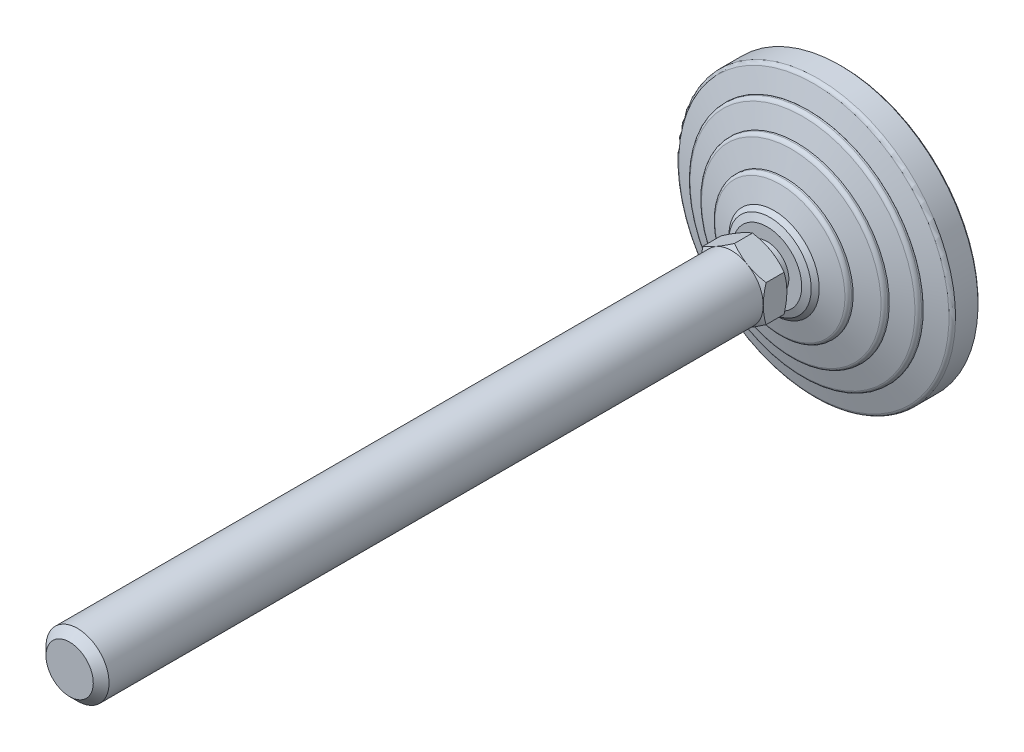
ISO-10303-21;
HEADER;
FILE_DESCRIPTION(('STEP AP214'),'2;1');
FILE_NAME('part.step','',(''),(''),'','','');
FILE_SCHEMA(('AUTOMOTIVE_DESIGN { 1 0 10303 214 1 1 1 1 }'));
ENDSEC;
DATA;
#1=APPLICATION_CONTEXT('core data for automotive mechanical design processes');
#2=APPLICATION_PROTOCOL_DEFINITION('international standard','automotive_design',2000,#1);
#3=PRODUCT_CONTEXT('',#1,'mechanical');
#4=PRODUCT('Part','Part','',(#3));
#5=PRODUCT_RELATED_PRODUCT_CATEGORY('part','',(#4));
#6=PRODUCT_DEFINITION_FORMATION('','',#4);
#7=PRODUCT_DEFINITION_CONTEXT('part definition',#1,'design');
#8=PRODUCT_DEFINITION('design','',#6,#7);
#9=PRODUCT_DEFINITION_SHAPE('','',#8);
#10=(LENGTH_UNIT() NAMED_UNIT(*) SI_UNIT(.MILLI.,.METRE.));
#11=(NAMED_UNIT(*) PLANE_ANGLE_UNIT() SI_UNIT($,.RADIAN.));
#12=(NAMED_UNIT(*) SI_UNIT($,.STERADIAN.) SOLID_ANGLE_UNIT());
#13=UNCERTAINTY_MEASURE_WITH_UNIT(LENGTH_MEASURE(1.E-05),#10,'distance_accuracy_value','');
#14=(GEOMETRIC_REPRESENTATION_CONTEXT(3) GLOBAL_UNCERTAINTY_ASSIGNED_CONTEXT((#13)) GLOBAL_UNIT_ASSIGNED_CONTEXT((#10,
#11,#12)) REPRESENTATION_CONTEXT('',''));
#15=CARTESIAN_POINT('',(0.,0.,0.));
#16=DIRECTION('',(0.,0.,1.));
#17=DIRECTION('',(1.,0.,0.));
#18=AXIS2_PLACEMENT_3D('',#15,#16,#17);
#19=CARTESIAN_POINT('',(-7.76470588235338,0.,21.9999999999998));
#20=DIRECTION('',(0.,0.,1.));
#21=DIRECTION('',(0.,-1.,0.));
#22=AXIS2_PLACEMENT_3D('',#19,#20,#21);
#23=PLANE('',#22);
#24=CARTESIAN_POINT('',(0.,0.,21.9999999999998));
#25=DIRECTION('',(0.,0.,-1.));
#26=DIRECTION('',(0.,1.,0.));
#27=AXIS2_PLACEMENT_3D('',#24,#25,#26);
#28=CIRCLE('',#27,5.50000000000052);
#29=CARTESIAN_POINT('',(0.,5.50000000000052,21.9999999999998));
#30=VERTEX_POINT('',#29);
#31=EDGE_CURVE('E338',#30,#30,#28,.T.);
#32=ORIENTED_EDGE('',*,*,#31,.F.);
#33=EDGE_LOOP('',(#32));
#34=FACE_BOUND('',#33,.T.);
#35=CARTESIAN_POINT('',(0.,0.,21.9999999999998));
#36=DIRECTION('',(0.,0.,-1.));
#37=DIRECTION('',(-1.,0.,0.));
#38=AXIS2_PLACEMENT_3D('',#35,#36,#37);
#39=CIRCLE('',#38,8.00000000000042);
#40=CARTESIAN_POINT('',(4.,6.92820323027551,21.9999999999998));
#41=VERTEX_POINT('',#40);
#42=CARTESIAN_POINT('',(8.,0.,21.9999999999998));
#43=VERTEX_POINT('',#42);
#44=EDGE_CURVE('E491',#41,#43,#39,.T.);
#45=ORIENTED_EDGE('',*,*,#44,.T.);
#46=CARTESIAN_POINT('',(4.,-6.92820323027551,21.9999999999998));
#47=VERTEX_POINT('',#46);
#48=EDGE_CURVE('E140',#43,#47,#39,.T.);
#49=ORIENTED_EDGE('',*,*,#48,.T.);
#50=CARTESIAN_POINT('',(-4.,-6.92820323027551,21.9999999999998));
#51=VERTEX_POINT('',#50);
#52=EDGE_CURVE('E139',#47,#51,#39,.T.);
#53=ORIENTED_EDGE('',*,*,#52,.T.);
#54=CARTESIAN_POINT('',(-8.,0.,21.9999999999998));
#55=VERTEX_POINT('',#54);
#56=EDGE_CURVE('E117',#51,#55,#39,.T.);
#57=ORIENTED_EDGE('',*,*,#56,.T.);
#58=CARTESIAN_POINT('',(-4.,6.92820323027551,21.9999999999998));
#59=VERTEX_POINT('',#58);
#60=EDGE_CURVE('E105',#55,#59,#39,.T.);
#61=ORIENTED_EDGE('',*,*,#60,.T.);
#62=EDGE_CURVE('E34',#59,#41,#39,.T.);
#63=ORIENTED_EDGE('',*,*,#62,.T.);
#64=EDGE_LOOP('',(#45,#49,#53,#57,#61,#63));
#65=FACE_BOUND('',#64,.T.);
#66=ADVANCED_FACE('F14',(#34,#65),#23,.F.);
#67=CARTESIAN_POINT('',(0.,0.,0.));
#68=DIRECTION('',(0.,0.,-1.));
#69=DIRECTION('',(0.,1.,0.));
#70=AXIS2_PLACEMENT_3D('',#67,#68,#69);
#71=CYLINDRICAL_SURFACE('',#70,5.50000000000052);
#72=CARTESIAN_POINT('',(0.,0.,19.));
#73=DIRECTION('',(0.,0.,-1.));
#74=DIRECTION('',(0.,1.,0.));
#75=AXIS2_PLACEMENT_3D('',#72,#73,#74);
#76=CIRCLE('',#75,5.50000000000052);
#77=CARTESIAN_POINT('',(0.,5.50000000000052,19.));
#78=VERTEX_POINT('',#77);
#79=EDGE_CURVE('E343',#78,#78,#76,.T.);
#80=ORIENTED_EDGE('',*,*,#79,.F.);
#81=EDGE_LOOP('',(#80));
#82=FACE_BOUND('',#81,.T.);
#83=ORIENTED_EDGE('',*,*,#31,.T.);
#84=EDGE_LOOP('',(#83));
#85=FACE_BOUND('',#84,.T.);
#86=ADVANCED_FACE('F305',(#82,#85),#71,.T.);
#87=CARTESIAN_POINT('',(-8.7540983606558,0.,19.));
#88=DIRECTION('',(0.,0.,-1.));
#89=DIRECTION('',(0.,1.,0.));
#90=AXIS2_PLACEMENT_3D('',#87,#88,#89);
#91=PLANE('',#90);
#92=CARTESIAN_POINT('',(0.,0.,19.));
#93=DIRECTION('',(0.,0.,-1.));
#94=DIRECTION('',(0.,1.,0.));
#95=AXIS2_PLACEMENT_3D('',#92,#93,#94);
#96=CIRCLE('',#95,8.7540983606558);
#97=CARTESIAN_POINT('',(0.,8.7540983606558,19.));
#98=VERTEX_POINT('',#97);
#99=EDGE_CURVE('E346',#98,#98,#96,.T.);
#100=ORIENTED_EDGE('',*,*,#99,.F.);
#101=EDGE_LOOP('',(#100));
#102=FACE_BOUND('',#101,.T.);
#103=ORIENTED_EDGE('',*,*,#79,.T.);
#104=EDGE_LOOP('',(#103));
#105=FACE_BOUND('',#104,.T.);
#106=ADVANCED_FACE('F301',(#102,#105),#91,.F.);
#107=CARTESIAN_POINT('',(0.,0.,19.));
#108=DIRECTION('',(0.,0.,-1.));
#109=DIRECTION('',(0.,1.,0.));
#110=AXIS2_PLACEMENT_3D('',#107,#108,#109);
#111=CONICAL_SURFACE('',#110,8.7540983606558,1.17809724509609);
#112=CARTESIAN_POINT('',(0.,0.,18.2928932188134));
#113=DIRECTION('',(0.,0.,-1.));
#114=DIRECTION('',(0.,1.,0.));
#115=AXIS2_PLACEMENT_3D('',#112,#113,#114);
#116=CIRCLE('',#115,10.4612051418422);
#117=CARTESIAN_POINT('',(0.,10.4612051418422,18.2928932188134));
#118=VERTEX_POINT('',#117);
#119=EDGE_CURVE('E349',#118,#118,#116,.T.);
#120=ORIENTED_EDGE('',*,*,#119,.F.);
#121=EDGE_LOOP('',(#120));
#122=FACE_BOUND('',#121,.T.);
#123=ORIENTED_EDGE('',*,*,#99,.T.);
#124=EDGE_LOOP('',(#123));
#125=FACE_BOUND('',#124,.T.);
#126=ADVANCED_FACE('F297',(#122,#125),#111,.T.);
#127=CARTESIAN_POINT('',(0.,0.,18.2928932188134));
#128=DIRECTION('',(0.,0.,-1.));
#129=DIRECTION('',(0.,1.,0.));
#130=AXIS2_PLACEMENT_3D('',#127,#128,#129);
#131=CONICAL_SURFACE('',#130,10.4612051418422,0.785398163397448);
#132=CARTESIAN_POINT('',(0.,0.,17.27868852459));
#133=DIRECTION('',(0.,0.,-1.));
#134=DIRECTION('',(0.,1.,0.));
#135=AXIS2_PLACEMENT_3D('',#132,#133,#134);
#136=CIRCLE('',#135,11.4754098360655);
#137=CARTESIAN_POINT('',(0.,11.4754098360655,17.27868852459));
#138=VERTEX_POINT('',#137);
#139=EDGE_CURVE('E352',#138,#138,#136,.T.);
#140=ORIENTED_EDGE('',*,*,#139,.F.);
#141=EDGE_LOOP('',(#140));
#142=FACE_BOUND('',#141,.T.);
#143=ORIENTED_EDGE('',*,*,#119,.T.);
#144=EDGE_LOOP('',(#143));
#145=FACE_BOUND('',#144,.T.);
#146=ADVANCED_FACE('F293',(#142,#145),#131,.T.);
#147=CARTESIAN_POINT('',(0.,0.,17.27868852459));
#148=DIRECTION('',(0.,0.,-1.));
#149=DIRECTION('',(0.,1.,0.));
#150=AXIS2_PLACEMENT_3D('',#147,#148,#149);
#151=CONICAL_SURFACE('',#150,11.4754098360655,1.27933953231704);
#152=CARTESIAN_POINT('',(0.,0.,15.7711726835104));
#153=DIRECTION('',(0.,0.,-1.));
#154=DIRECTION('',(0.,1.,0.));
#155=AXIS2_PLACEMENT_3D('',#152,#153,#154);
#156=CIRCLE('',#155,16.5004626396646);
#157=CARTESIAN_POINT('',(0.,16.5004626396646,15.7711726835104));
#158=VERTEX_POINT('',#157);
#159=EDGE_CURVE('E355',#158,#158,#156,.T.);
#160=ORIENTED_EDGE('',*,*,#159,.F.);
#161=EDGE_LOOP('',(#160));
#162=FACE_BOUND('',#161,.T.);
#163=ORIENTED_EDGE('',*,*,#139,.T.);
#164=EDGE_LOOP('',(#163));
#165=FACE_BOUND('',#164,.T.);
#166=ADVANCED_FACE('F289',(#162,#165),#151,.T.);
#167=CARTESIAN_POINT('',(0.,0.,14.8133463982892));
#168=DIRECTION('',(0.,0.,-1.));
#169=DIRECTION('',(0.,1.,0.));
#170=AXIS2_PLACEMENT_3D('',#167,#168,#169);
#171=TOROIDAL_SURFACE('',#170,16.2131147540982,1.);
#172=CARTESIAN_POINT('',(0.,0.,14.8133463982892));
#173=DIRECTION('',(0.,0.,-1.));
#174=DIRECTION('',(0.,1.,0.));
#175=AXIS2_PLACEMENT_3D('',#172,#173,#174);
#176=CIRCLE('',#175,17.2131147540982);
#177=CARTESIAN_POINT('',(0.,17.2131147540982,14.8133463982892));
#178=VERTEX_POINT('',#177);
#179=EDGE_CURVE('E358',#178,#178,#176,.T.);
#180=ORIENTED_EDGE('',*,*,#179,.F.);
#181=EDGE_LOOP('',(#180));
#182=FACE_BOUND('',#181,.T.);
#183=ORIENTED_EDGE('',*,*,#159,.T.);
#184=EDGE_LOOP('',(#183));
#185=FACE_BOUND('',#184,.T.);
#186=ADVANCED_FACE('F285',(#182,#185),#171,.T.);
#187=CARTESIAN_POINT('',(0.,0.,0.));
#188=DIRECTION('',(0.,0.,-1.));
#189=DIRECTION('',(0.,1.,0.));
#190=AXIS2_PLACEMENT_3D('',#187,#188,#189);
#191=CYLINDRICAL_SURFACE('',#190,17.2131147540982);
#192=CARTESIAN_POINT('',(0.,0.,14.4098360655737));
#193=DIRECTION('',(0.,0.,-1.));
#194=DIRECTION('',(0.,1.,0.));
#195=AXIS2_PLACEMENT_3D('',#192,#193,#194);
#196=CIRCLE('',#195,17.2131147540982);
#197=CARTESIAN_POINT('',(0.,17.2131147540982,14.4098360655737));
#198=VERTEX_POINT('',#197);
#199=EDGE_CURVE('E361',#198,#198,#196,.T.);
#200=ORIENTED_EDGE('',*,*,#199,.F.);
#201=EDGE_LOOP('',(#200));
#202=FACE_BOUND('',#201,.T.);
#203=ORIENTED_EDGE('',*,*,#179,.T.);
#204=EDGE_LOOP('',(#203));
#205=FACE_BOUND('',#204,.T.);
#206=ADVANCED_FACE('F281',(#202,#205),#191,.T.);
#207=CARTESIAN_POINT('',(0.,0.,14.4098360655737));
#208=DIRECTION('',(0.,0.,-1.));
#209=DIRECTION('',(0.,1.,0.));
#210=AXIS2_PLACEMENT_3D('',#207,#208,#209);
#211=CONICAL_SURFACE('',#210,17.2131147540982,1.30454427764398);
#212=CARTESIAN_POINT('',(0.,0.,12.8894925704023));
#213=DIRECTION('',(0.,0.,-1.));
#214=DIRECTION('',(0.,1.,0.));
#215=AXIS2_PLACEMENT_3D('',#212,#213,#214);
#216=CIRCLE('',#215,22.7877075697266);
#217=CARTESIAN_POINT('',(0.,22.7877075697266,12.8894925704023));
#218=VERTEX_POINT('',#217);
#219=EDGE_CURVE('E364',#218,#218,#216,.T.);
#220=ORIENTED_EDGE('',*,*,#219,.F.);
#221=EDGE_LOOP('',(#220));
#222=FACE_BOUND('',#221,.T.);
#223=ORIENTED_EDGE('',*,*,#199,.T.);
#224=EDGE_LOOP('',(#223));
#225=FACE_BOUND('',#224,.T.);
#226=ADVANCED_FACE('F277',(#222,#225),#211,.T.);
#227=CARTESIAN_POINT('',(0.,0.,11.9247287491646));
#228=DIRECTION('',(0.,0.,-1.));
#229=DIRECTION('',(0.,1.,0.));
#230=AXIS2_PLACEMENT_3D('',#227,#228,#229);
#231=TOROIDAL_SURFACE('',#230,22.5245901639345,1.);
#232=CARTESIAN_POINT('',(0.,0.,11.9247287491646));
#233=DIRECTION('',(0.,0.,-1.));
#234=DIRECTION('',(0.,1.,0.));
#235=AXIS2_PLACEMENT_3D('',#232,#233,#234);
#236=CIRCLE('',#235,23.5245901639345);
#237=CARTESIAN_POINT('',(0.,23.5245901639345,11.9247287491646));
#238=VERTEX_POINT('',#237);
#239=EDGE_CURVE('E367',#238,#238,#236,.T.);
#240=ORIENTED_EDGE('',*,*,#239,.F.);
#241=EDGE_LOOP('',(#240));
#242=FACE_BOUND('',#241,.T.);
#243=ORIENTED_EDGE('',*,*,#219,.T.);
#244=EDGE_LOOP('',(#243));
#245=FACE_BOUND('',#244,.T.);
#246=ADVANCED_FACE('F273',(#242,#245),#231,.T.);
#247=CARTESIAN_POINT('',(0.,0.,0.));
#248=DIRECTION('',(0.,0.,-1.));
#249=DIRECTION('',(0.,1.,0.));
#250=AXIS2_PLACEMENT_3D('',#247,#248,#249);
#251=CYLINDRICAL_SURFACE('',#250,23.5245901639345);
#252=CARTESIAN_POINT('',(0.,0.,11.5409836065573));
#253=DIRECTION('',(0.,0.,-1.));
#254=DIRECTION('',(0.,1.,0.));
#255=AXIS2_PLACEMENT_3D('',#252,#253,#254);
#256=CIRCLE('',#255,23.5245901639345);
#257=CARTESIAN_POINT('',(0.,23.5245901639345,11.5409836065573));
#258=VERTEX_POINT('',#257);
#259=EDGE_CURVE('E370',#258,#258,#256,.T.);
#260=ORIENTED_EDGE('',*,*,#259,.F.);
#261=EDGE_LOOP('',(#260));
#262=FACE_BOUND('',#261,.T.);
#263=ORIENTED_EDGE('',*,*,#239,.T.);
#264=EDGE_LOOP('',(#263));
#265=FACE_BOUND('',#264,.T.);
#266=ADVANCED_FACE('F269',(#262,#265),#251,.T.);
#267=CARTESIAN_POINT('',(0.,0.,11.5409836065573));
#268=DIRECTION('',(0.,0.,-1.));
#269=DIRECTION('',(0.,1.,0.));
#270=AXIS2_PLACEMENT_3D('',#267,#268,#269);
#271=CONICAL_SURFACE('',#270,23.5245901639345,1.27871257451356);
#272=CARTESIAN_POINT('',(0.,0.,10.0337743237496));
#273=DIRECTION('',(0.,0.,-1.));
#274=DIRECTION('',(0.,1.,0.));
#275=AXIS2_PLACEMENT_3D('',#272,#273,#274);
#276=CIRCLE('',#275,28.5372004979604);
#277=CARTESIAN_POINT('',(0.,28.5372004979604,10.0337743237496));
#278=VERTEX_POINT('',#277);
#279=EDGE_CURVE('E373',#278,#278,#276,.T.);
#280=ORIENTED_EDGE('',*,*,#279,.F.);
#281=EDGE_LOOP('',(#280));
#282=FACE_BOUND('',#281,.T.);
#283=ORIENTED_EDGE('',*,*,#259,.T.);
#284=EDGE_LOOP('',(#283));
#285=FACE_BOUND('',#284,.T.);
#286=ADVANCED_FACE('F265',(#282,#285),#271,.T.);
#287=CARTESIAN_POINT('',(0.,0.,9.07612838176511));
#288=DIRECTION('',(0.,0.,-1.));
#289=DIRECTION('',(0.,1.,0.));
#290=AXIS2_PLACEMENT_3D('',#287,#288,#289);
#291=TOROIDAL_SURFACE('',#290,28.2492521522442,1.);
#292=CARTESIAN_POINT('',(0.,0.,9.07612838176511));
#293=DIRECTION('',(0.,0.,-1.));
#294=DIRECTION('',(0.,1.,0.));
#295=AXIS2_PLACEMENT_3D('',#292,#293,#294);
#296=CIRCLE('',#295,29.2492521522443);
#297=CARTESIAN_POINT('',(0.,29.2492521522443,9.07612838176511));
#298=VERTEX_POINT('',#297);
#299=EDGE_CURVE('E376',#298,#298,#296,.T.);
#300=ORIENTED_EDGE('',*,*,#299,.F.);
#301=EDGE_LOOP('',(#300));
#302=FACE_BOUND('',#301,.T.);
#303=ORIENTED_EDGE('',*,*,#279,.T.);
#304=EDGE_LOOP('',(#303));
#305=FACE_BOUND('',#304,.T.);
#306=ADVANCED_FACE('F261',(#302,#305),#291,.T.);
#307=CARTESIAN_POINT('',(0.,0.,0.));
#308=DIRECTION('',(0.,0.,-1.));
#309=DIRECTION('',(0.,1.,0.));
#310=AXIS2_PLACEMENT_3D('',#307,#308,#309);
#311=CYLINDRICAL_SURFACE('',#310,29.2492521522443);
#312=CARTESIAN_POINT('',(0.,0.,8.67213114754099));
#313=DIRECTION('',(0.,0.,-1.));
#314=DIRECTION('',(0.,1.,0.));
#315=AXIS2_PLACEMENT_3D('',#312,#313,#314);
#316=CIRCLE('',#315,29.2492521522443);
#317=CARTESIAN_POINT('',(0.,29.2492521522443,8.67213114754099));
#318=VERTEX_POINT('',#317);
#319=EDGE_CURVE('E379',#318,#318,#316,.T.);
#320=ORIENTED_EDGE('',*,*,#319,.F.);
#321=EDGE_LOOP('',(#320));
#322=FACE_BOUND('',#321,.T.);
#323=ORIENTED_EDGE('',*,*,#299,.T.);
#324=EDGE_LOOP('',(#323));
#325=FACE_BOUND('',#324,.T.);
#326=ADVANCED_FACE('F257',(#322,#325),#311,.T.);
#327=CARTESIAN_POINT('',(-29.2622950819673,0.,8.67213114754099));
#328=DIRECTION('',(0.,0.,-1.));
#329=DIRECTION('',(0.,1.,0.));
#330=AXIS2_PLACEMENT_3D('',#327,#328,#329);
#331=PLANE('',#330);
#332=CARTESIAN_POINT('',(0.,0.,8.67213114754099));
#333=DIRECTION('',(0.,0.,-1.));
#334=DIRECTION('',(0.,1.,0.));
#335=AXIS2_PLACEMENT_3D('',#332,#333,#334);
#336=CIRCLE('',#335,29.2622950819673);
#337=CARTESIAN_POINT('',(0.,29.2622950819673,8.67213114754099));
#338=VERTEX_POINT('',#337);
#339=EDGE_CURVE('E382',#338,#338,#336,.T.);
#340=ORIENTED_EDGE('',*,*,#339,.F.);
#341=EDGE_LOOP('',(#340));
#342=FACE_BOUND('',#341,.T.);
#343=ORIENTED_EDGE('',*,*,#319,.T.);
#344=EDGE_LOOP('',(#343));
#345=FACE_BOUND('',#344,.T.);
#346=ADVANCED_FACE('F253',(#342,#345),#331,.F.);
#347=CARTESIAN_POINT('',(0.,0.,8.67213114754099));
#348=DIRECTION('',(0.,0.,-1.));
#349=DIRECTION('',(0.,1.,0.));
#350=AXIS2_PLACEMENT_3D('',#347,#348,#349);
#351=CONICAL_SURFACE('',#350,29.2622950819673,1.27933953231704);
#352=CARTESIAN_POINT('',(0.,0.,7.16461530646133));
#353=DIRECTION('',(0.,0.,-1.));
#354=DIRECTION('',(0.,1.,0.));
#355=AXIS2_PLACEMENT_3D('',#352,#353,#354);
#356=CIRCLE('',#355,34.2873478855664);
#357=CARTESIAN_POINT('',(0.,34.2873478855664,7.16461530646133));
#358=VERTEX_POINT('',#357);
#359=EDGE_CURVE('E385',#358,#358,#356,.T.);
#360=ORIENTED_EDGE('',*,*,#359,.F.);
#361=EDGE_LOOP('',(#360));
#362=FACE_BOUND('',#361,.T.);
#363=ORIENTED_EDGE('',*,*,#339,.T.);
#364=EDGE_LOOP('',(#363));
#365=FACE_BOUND('',#364,.T.);
#366=ADVANCED_FACE('F249',(#362,#365),#351,.T.);
#367=CARTESIAN_POINT('',(0.,0.,6.20678902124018));
#368=DIRECTION('',(0.,0.,-1.));
#369=DIRECTION('',(0.,1.,0.));
#370=AXIS2_PLACEMENT_3D('',#367,#368,#369);
#371=TOROIDAL_SURFACE('',#370,34.,1.);
#372=CARTESIAN_POINT('',(0.,0.,6.20678902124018));
#373=DIRECTION('',(0.,0.,-1.));
#374=DIRECTION('',(0.,1.,0.));
#375=AXIS2_PLACEMENT_3D('',#372,#373,#374);
#376=CIRCLE('',#375,35.);
#377=CARTESIAN_POINT('',(0.,35.,6.20678902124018));
#378=VERTEX_POINT('',#377);
#379=EDGE_CURVE('E388',#378,#378,#376,.T.);
#380=ORIENTED_EDGE('',*,*,#379,.F.);
#381=EDGE_LOOP('',(#380));
#382=FACE_BOUND('',#381,.T.);
#383=ORIENTED_EDGE('',*,*,#359,.T.);
#384=EDGE_LOOP('',(#383));
#385=FACE_BOUND('',#384,.T.);
#386=ADVANCED_FACE('F245',(#382,#385),#371,.T.);
#387=CARTESIAN_POINT('',(0.,0.,0.));
#388=DIRECTION('',(0.,0.,-1.));
#389=DIRECTION('',(0.,1.,0.));
#390=AXIS2_PLACEMENT_3D('',#387,#388,#389);
#391=CYLINDRICAL_SURFACE('',#390,35.);
#392=CARTESIAN_POINT('',(0.,0.,0.5));
#393=DIRECTION('',(0.,0.,-1.));
#394=DIRECTION('',(0.,1.,0.));
#395=AXIS2_PLACEMENT_3D('',#392,#393,#394);
#396=CIRCLE('',#395,35.);
#397=CARTESIAN_POINT('',(0.,35.,0.5));
#398=VERTEX_POINT('',#397);
#399=EDGE_CURVE('E391',#398,#398,#396,.T.);
#400=ORIENTED_EDGE('',*,*,#399,.F.);
#401=EDGE_LOOP('',(#400));
#402=FACE_BOUND('',#401,.T.);
#403=ORIENTED_EDGE('',*,*,#379,.T.);
#404=EDGE_LOOP('',(#403));
#405=FACE_BOUND('',#404,.T.);
#406=ADVANCED_FACE('F241',(#402,#405),#391,.T.);
#407=CARTESIAN_POINT('',(0.,0.,0.5));
#408=DIRECTION('',(0.,0.,1.));
#409=DIRECTION('',(0.,-1.,0.));
#410=AXIS2_PLACEMENT_3D('',#407,#408,#409);
#411=CONICAL_SURFACE('',#410,35.,0.785398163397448);
#412=CARTESIAN_POINT('',(0.,0.,0.));
#413=DIRECTION('',(0.,0.,-1.));
#414=DIRECTION('',(0.,1.,0.));
#415=AXIS2_PLACEMENT_3D('',#412,#413,#414);
#416=CIRCLE('',#415,34.5);
#417=CARTESIAN_POINT('',(0.,34.5,0.));
#418=VERTEX_POINT('',#417);
#419=EDGE_CURVE('E394',#418,#418,#416,.T.);
#420=ORIENTED_EDGE('',*,*,#419,.F.);
#421=EDGE_LOOP('',(#420));
#422=FACE_BOUND('',#421,.T.);
#423=ORIENTED_EDGE('',*,*,#399,.T.);
#424=EDGE_LOOP('',(#423));
#425=FACE_BOUND('',#424,.T.);
#426=ADVANCED_FACE('F237',(#422,#425),#411,.T.);
#427=CARTESIAN_POINT('',(-34.5,0.,0.));
#428=DIRECTION('',(0.,0.,1.));
#429=DIRECTION('',(0.,-1.,0.));
#430=AXIS2_PLACEMENT_3D('',#427,#428,#429);
#431=PLANE('',#430);
#432=ORIENTED_EDGE('',*,*,#419,.T.);
#433=EDGE_LOOP('',(#432));
#434=FACE_BOUND('',#433,.T.);
#435=ADVANCED_FACE('F233',(#434),#431,.F.);
#436=CARTESIAN_POINT('',(0.,0.,23.788467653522));
#437=DIRECTION('',(0.,0.,1.));
#438=DIRECTION('',(1.,0.,0.));
#439=AXIS2_PLACEMENT_3D('',#436,#437,#438);
#440=CONICAL_SURFACE('',#439,11.0977168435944,1.0471975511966);
#441=CARTESIAN_POINT('',(8.,-12.3993294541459,25.9006534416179));
#442=CARTESIAN_POINT('',(8.,-12.0499853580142,25.731219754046));
#443=CARTESIAN_POINT('',(8.,-11.6998385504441,25.5634127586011));
#444=CARTESIAN_POINT('',(8.,-10.9975126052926,25.2319671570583));
#445=CARTESIAN_POINT('',(8.,-10.6453331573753,25.068329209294));
#446=CARTESIAN_POINT('',(8.,-9.93669690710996,24.7453118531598));
#447=CARTESIAN_POINT('',(8.,-9.58022725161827,24.585960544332));
#448=CARTESIAN_POINT('',(8.,-8.8644502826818,24.2737886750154));
#449=CARTESIAN_POINT('',(8.,-8.5051431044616,24.1209678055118));
#450=CARTESIAN_POINT('',(8.,-7.77153504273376,23.818809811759));
#451=CARTESIAN_POINT('',(8.,-7.39712281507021,23.6697415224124));
#452=CARTESIAN_POINT('',(8.,-6.64391613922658,23.3829047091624));
#453=CARTESIAN_POINT('',(8.,-6.26512120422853,23.2451374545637));
#454=CARTESIAN_POINT('',(8.,-5.50325331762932,22.9845252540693));
#455=CARTESIAN_POINT('',(8.,-5.120190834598,22.8616500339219));
#456=CARTESIAN_POINT('',(8.,-4.34858472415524,22.6347680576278));
#457=CARTESIAN_POINT('',(8.,-3.9600428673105,22.5307553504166));
#458=CARTESIAN_POINT('',(8.,-3.17935612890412,22.3471566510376));
#459=CARTESIAN_POINT('',(8.,-2.7872433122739,22.2674380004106));
#460=CARTESIAN_POINT('',(8.,-2.19550914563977,22.1695335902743));
#461=CARTESIAN_POINT('',(8.,-1.99765564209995,22.1405097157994));
#462=CARTESIAN_POINT('',(8.,-1.60096769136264,22.0902559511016));
#463=CARTESIAN_POINT('',(8.,-1.4021333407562,22.0690253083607));
#464=CARTESIAN_POINT('',(8.,-1.00634403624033,22.0350468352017));
#465=CARTESIAN_POINT('',(8.,-0.809398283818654,22.0221922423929));
#466=CARTESIAN_POINT('',(8.,-0.4151397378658,22.0048224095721));
#467=CARTESIAN_POINT('',(8.,-0.217826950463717,22.0003070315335));
#468=CARTESIAN_POINT('',(8.,0.17681286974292,21.9997233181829));
#469=CARTESIAN_POINT('',(8.,0.374139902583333,22.0036550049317));
#470=CARTESIAN_POINT('',(8.,0.768453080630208,22.019869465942));
#471=CARTESIAN_POINT('',(8.,0.965439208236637,22.0321526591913));
#472=CARTESIAN_POINT('',(8.,1.43909061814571,22.0714686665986));
#473=CARTESIAN_POINT('',(8.,1.71543284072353,22.1024770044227));
#474=CARTESIAN_POINT('',(8.,2.26604836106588,22.1792357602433));
#475=CARTESIAN_POINT('',(8.,2.54032137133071,22.2249881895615));
#476=CARTESIAN_POINT('',(8.,3.35973401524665,22.3819340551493));
#477=CARTESIAN_POINT('',(8.,3.90115700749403,22.5127869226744));
#478=CARTESIAN_POINT('',(8.,4.71069252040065,22.7394700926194));
#479=CARTESIAN_POINT('',(8.,4.9830102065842,22.8211447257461));
#480=CARTESIAN_POINT('',(8.,5.52500039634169,22.9929218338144));
#481=CARTESIAN_POINT('',(8.,5.79467288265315,23.0830243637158));
#482=CARTESIAN_POINT('',(8.,6.33145827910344,23.2702162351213));
#483=CARTESIAN_POINT('',(8.,6.59857201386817,23.3673032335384));
#484=CARTESIAN_POINT('',(8.,7.13059039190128,23.5673272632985));
#485=CARTESIAN_POINT('',(8.,7.39549505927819,23.6702642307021));
#486=CARTESIAN_POINT('',(8.,8.013270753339,23.9169225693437));
#487=CARTESIAN_POINT('',(8.,8.36536298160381,24.0625907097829));
#488=CARTESIAN_POINT('',(8.,9.06660579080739,24.360863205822));
#489=CARTESIAN_POINT('',(8.,9.41575620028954,24.5134679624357));
#490=CARTESIAN_POINT('',(8.,10.1116528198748,24.8242459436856));
#491=CARTESIAN_POINT('',(8.,10.4583985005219,24.9824203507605));
#492=CARTESIAN_POINT('',(8.,11.1498056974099,25.3032319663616));
#493=CARTESIAN_POINT('',(8.,11.4944672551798,25.4658690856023));
#494=CARTESIAN_POINT('',(8.,12.1824098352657,25.7949559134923));
#495=CARTESIAN_POINT('',(8.,12.525689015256,25.961409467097));
#496=CARTESIAN_POINT('',(8.,13.2107740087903,26.2973242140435));
#497=CARTESIAN_POINT('',(8.,13.5525798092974,26.4667854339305));
#498=CARTESIAN_POINT('',(8.,14.5760468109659,26.9788479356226));
#499=CARTESIAN_POINT('',(8.,15.2558459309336,27.3251706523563));
#500=CARTESIAN_POINT('',(8.,16.5561019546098,27.9960781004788));
#501=CARTESIAN_POINT('',(8.,17.1768450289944,28.3201106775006));
#502=CARTESIAN_POINT('',(8.,18.4160044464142,28.9726418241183));
#503=CARTESIAN_POINT('',(8.,19.0344207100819,29.3011405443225));
#504=CARTESIAN_POINT('',(8.,20.2679321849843,29.9607445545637));
#505=CARTESIAN_POINT('',(8.,20.8830318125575,30.2918415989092));
#506=CARTESIAN_POINT('',(8.,22.1117387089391,30.9567158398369));
#507=CARTESIAN_POINT('',(8.,22.7253460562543,31.2904928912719));
#508=CARTESIAN_POINT('',(8.,23.3384020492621,31.6252727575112));
#509=B_SPLINE_CURVE_WITH_KNOTS('',3,(#441,#442,#443,#444,#445,#446,#447,#448,#449,#450,#451,
#452,#453,#454,#455,#456,#457,#458,#459,#460,#461,#462,#463,#464,#465,#466,#467,#468,#469,#470,
#471,#472,#473,#474,#475,#476,#477,#478,#479,#480,#481,#482,#483,#484,#485,#486,#487,#488,#489,
#490,#491,#492,#493,#494,#495,#496,#497,#498,#499,#500,#501,#502,#503,#504,#505,#506,#507,#508),
.UNSPECIFIED.,.F.,.F.,(4,2,2,2,2,2,2,2,2,2,2,2,2,2,2,2,2,2,2,2,2,2,2,2,2,2,2,2,2,2,2,2,2,4),(0.,
1.16480678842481,2.32979638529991,3.50114096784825,4.6724300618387,5.88127686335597,
7.09025925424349,8.29674112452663,9.50284168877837,10.7022331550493,11.3020167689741,
11.9017424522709,12.49366612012,13.0855799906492,13.6774954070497,14.2694405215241,
15.1031986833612,15.937070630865,17.6057451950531,18.4585809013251,19.3114221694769,
20.1639786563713,21.0165258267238,22.1595333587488,23.3026070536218,24.4459249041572,
25.5892198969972,26.7337222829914,27.8782347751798,30.1669656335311,32.2676298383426,
34.3683650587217,36.4640095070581,38.5595412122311),.UNSPECIFIED.);
#510=CARTESIAN_POINT('',(8.,4.61880215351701,22.7145311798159));
#511=VERTEX_POINT('',#510);
#512=EDGE_CURVE('E115',#511,#43,#509,.F.);
#513=ORIENTED_EDGE('',*,*,#512,.T.);
#514=ORIENTED_EDGE('',*,*,#44,.F.);
#515=CARTESIAN_POINT('',(-0.000199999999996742,9.23771977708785,22.7145978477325));
#516=CARTESIAN_POINT('',(0.175648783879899,9.13619343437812,22.6559907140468));
#517=CARTESIAN_POINT('',(0.352153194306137,9.03428856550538,22.6000434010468));
#518=CARTESIAN_POINT('',(0.706595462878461,8.82965122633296,22.4942010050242));
#519=CARTESIAN_POINT('',(0.884533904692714,8.72691841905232,22.4443085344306));
#520=CARTESIAN_POINT('',(1.42119823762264,8.41707512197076,22.3046927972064));
#521=CARTESIAN_POINT('',(1.78204258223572,8.20874154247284,22.2252811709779));
#522=CARTESIAN_POINT('',(2.32203917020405,7.89697436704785,22.132161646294));
#523=CARTESIAN_POINT('',(2.49957818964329,7.79447216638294,22.1056345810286));
#524=CARTESIAN_POINT('',(2.8554591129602,7.58900421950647,22.0611531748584));
#525=CARTESIAN_POINT('',(3.03380094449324,7.4860385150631,22.0431980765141));
#526=CARTESIAN_POINT('',(3.3907916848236,7.27992981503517,22.0163156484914));
#527=CARTESIAN_POINT('',(3.5694400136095,7.17678715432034,22.0073780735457));
#528=CARTESIAN_POINT('',(3.92690170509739,6.97040655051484,21.9987223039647));
#529=CARTESIAN_POINT('',(4.10571506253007,6.86716861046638,21.9990038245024));
#530=CARTESIAN_POINT('',(4.44001336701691,6.67416139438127,22.0081450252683));
#531=CARTESIAN_POINT('',(4.59552190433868,6.58437849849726,22.0158896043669));
#532=CARTESIAN_POINT('',(4.90617476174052,6.40502298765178,22.0382011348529));
#533=CARTESIAN_POINT('',(5.06131905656,6.31545038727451,22.0527685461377));
#534=CARTESIAN_POINT('',(5.52615131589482,6.04707935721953,22.1063606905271));
#535=CARTESIAN_POINT('',(5.83501648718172,5.86875596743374,22.1552686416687));
#536=CARTESIAN_POINT('',(6.4560232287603,5.51021755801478,22.2775394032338));
#537=CARTESIAN_POINT('',(6.76808554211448,5.33004829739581,22.3514205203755));
#538=CARTESIAN_POINT('',(7.38755648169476,4.97239658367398,22.5191001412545));
#539=CARTESIAN_POINT('',(7.69497304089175,4.79490955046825,22.612859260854));
#540=CARTESIAN_POINT('',(8.0002,4.61868668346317,22.7145978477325));
#541=B_SPLINE_CURVE_WITH_KNOTS('',3,(#515,#516,#517,#518,#519,#520,#521,#522,#523,#524,#525,
#526,#527,#528,#529,#530,#531,#532,#533,#534,#535,#536,#537,#538,#539,#540),.UNSPECIFIED.,.F.,
.F.,(4,2,2,2,2,2,2,2,2,2,2,2,4),(0.,0.63397354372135,1.26821965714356,2.53934712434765,
3.15934343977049,3.77928496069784,4.39852133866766,5.01773858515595,5.55680239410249,
6.09590254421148,7.17487077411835,8.27776850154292,9.37850115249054),.UNSPECIFIED.);
#542=EDGE_CURVE('E18',#41,#511,#541,.T.);
#543=ORIENTED_EDGE('',*,*,#542,.T.);
#544=EDGE_LOOP('',(#513,#514,#543));
#545=FACE_BOUND('',#544,.T.);
#546=ADVANCED_FACE('F157',(#545),#440,.T.);
#547=CARTESIAN_POINT('',(-8.0002,4.61868668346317,22.7145978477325));
#548=CARTESIAN_POINT('',(-7.8243512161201,4.7202130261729,22.6559907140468));
#549=CARTESIAN_POINT('',(-7.64784680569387,4.82211789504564,22.6000434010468));
#550=CARTESIAN_POINT('',(-7.29340453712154,5.02675523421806,22.4942010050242));
#551=CARTESIAN_POINT('',(-7.11546609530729,5.1294880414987,22.4443085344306));
#552=CARTESIAN_POINT('',(-6.57880176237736,5.43933133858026,22.3046927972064));
#553=CARTESIAN_POINT('',(-6.21795741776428,5.64766491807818,22.2252811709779));
#554=CARTESIAN_POINT('',(-5.67796082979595,5.95943209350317,22.132161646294));
#555=CARTESIAN_POINT('',(-5.50042181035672,6.06193429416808,22.1056345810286));
#556=CARTESIAN_POINT('',(-5.1445408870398,6.26740224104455,22.0611531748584));
#557=CARTESIAN_POINT('',(-4.96619905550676,6.37036794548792,22.0431980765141));
#558=CARTESIAN_POINT('',(-4.60920831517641,6.57647664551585,22.0163156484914));
#559=CARTESIAN_POINT('',(-4.4305599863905,6.67961930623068,22.0073780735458));
#560=CARTESIAN_POINT('',(-4.07309829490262,6.88599991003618,21.9987223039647));
#561=CARTESIAN_POINT('',(-3.89428493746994,6.98923785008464,21.9990038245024));
#562=CARTESIAN_POINT('',(-3.5599866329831,7.18224506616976,22.0081450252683));
#563=CARTESIAN_POINT('',(-3.40447809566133,7.27202796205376,22.0158896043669));
#564=CARTESIAN_POINT('',(-3.09382523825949,7.45138347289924,22.0382011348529));
#565=CARTESIAN_POINT('',(-2.93868094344,7.54095607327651,22.0527685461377));
#566=CARTESIAN_POINT('',(-2.47384868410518,7.80932710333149,22.1063606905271));
#567=CARTESIAN_POINT('',(-2.16498351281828,7.98765049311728,22.1552686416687));
#568=CARTESIAN_POINT('',(-1.5439767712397,8.34618890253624,22.2775394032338));
#569=CARTESIAN_POINT('',(-1.23191445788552,8.52635816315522,22.3514205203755));
#570=CARTESIAN_POINT('',(-0.61244351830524,8.88400987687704,22.5191001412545));
#571=CARTESIAN_POINT('',(-0.305026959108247,9.06149691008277,22.612859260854));
#572=CARTESIAN_POINT('',(0.000200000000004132,9.23771977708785,22.7145978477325));
#573=B_SPLINE_CURVE_WITH_KNOTS('',3,(#547,#548,#549,#550,#551,#552,#553,#554,#555,#556,#557,
#558,#559,#560,#561,#562,#563,#564,#565,#566,#567,#568,#569,#570,#571,#572),.UNSPECIFIED.,.F.,
.F.,(4,2,2,2,2,2,2,2,2,2,2,2,4),(0.,0.63397354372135,1.26821965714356,2.53934712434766,
3.15934343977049,3.77928496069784,4.39852133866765,5.01773858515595,5.55680239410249,
6.09590254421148,7.17487077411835,8.27776850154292,9.37850115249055),.UNSPECIFIED.);
#574=CARTESIAN_POINT('',(0.,9.23760430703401,22.7145311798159));
#575=VERTEX_POINT('',#574);
#576=EDGE_CURVE('E149',#59,#575,#573,.T.);
#577=ORIENTED_EDGE('',*,*,#576,.T.);
#578=EDGE_CURVE('E9',#575,#41,#541,.T.);
#579=ORIENTED_EDGE('',*,*,#578,.T.);
#580=ORIENTED_EDGE('',*,*,#62,.F.);
#581=EDGE_LOOP('',(#577,#579,#580));
#582=FACE_BOUND('',#581,.T.);
#583=ADVANCED_FACE('F484',(#582),#440,.T.);
#584=CARTESIAN_POINT('',(8.0002,-4.61868668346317,22.7145978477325));
#585=CARTESIAN_POINT('',(7.8243512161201,-4.7202130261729,22.6559907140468));
#586=CARTESIAN_POINT('',(7.64784680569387,-4.82211789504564,22.6000434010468));
#587=CARTESIAN_POINT('',(7.29340453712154,-5.02675523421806,22.4942010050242));
#588=CARTESIAN_POINT('',(7.11546609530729,-5.1294880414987,22.4443085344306));
#589=CARTESIAN_POINT('',(6.57880176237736,-5.43933133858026,22.3046927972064));
#590=CARTESIAN_POINT('',(6.21795741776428,-5.64766491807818,22.2252811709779));
#591=CARTESIAN_POINT('',(5.67796082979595,-5.95943209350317,22.132161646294));
#592=CARTESIAN_POINT('',(5.50042181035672,-6.06193429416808,22.1056345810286));
#593=CARTESIAN_POINT('',(5.1445408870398,-6.26740224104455,22.0611531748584));
#594=CARTESIAN_POINT('',(4.96619905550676,-6.37036794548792,22.0431980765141));
#595=CARTESIAN_POINT('',(4.60920831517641,-6.57647664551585,22.0163156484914));
#596=CARTESIAN_POINT('',(4.4305599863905,-6.67961930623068,22.0073780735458));
#597=CARTESIAN_POINT('',(4.07309829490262,-6.88599991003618,21.9987223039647));
#598=CARTESIAN_POINT('',(3.89428493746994,-6.98923785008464,21.9990038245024));
#599=CARTESIAN_POINT('',(3.5599866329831,-7.18224506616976,22.0081450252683));
#600=CARTESIAN_POINT('',(3.40447809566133,-7.27202796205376,22.0158896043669));
#601=CARTESIAN_POINT('',(3.09382523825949,-7.45138347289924,22.0382011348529));
#602=CARTESIAN_POINT('',(2.93868094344,-7.54095607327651,22.0527685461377));
#603=CARTESIAN_POINT('',(2.47384868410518,-7.80932710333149,22.1063606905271));
#604=CARTESIAN_POINT('',(2.16498351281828,-7.98765049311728,22.1552686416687));
#605=CARTESIAN_POINT('',(1.5439767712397,-8.34618890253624,22.2775394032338));
#606=CARTESIAN_POINT('',(1.23191445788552,-8.52635816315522,22.3514205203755));
#607=CARTESIAN_POINT('',(0.612443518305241,-8.88400987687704,22.5191001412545));
#608=CARTESIAN_POINT('',(0.305026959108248,-9.06149691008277,22.612859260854));
#609=CARTESIAN_POINT('',(-0.000200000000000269,-9.23771977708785,22.7145978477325));
#610=B_SPLINE_CURVE_WITH_KNOTS('',3,(#584,#585,#586,#587,#588,#589,#590,#591,#592,#593,#594,
#595,#596,#597,#598,#599,#600,#601,#602,#603,#604,#605,#606,#607,#608,#609),.UNSPECIFIED.,.F.,
.F.,(4,2,2,2,2,2,2,2,2,2,2,2,4),(0.,0.63397354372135,1.26821965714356,2.53934712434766,
3.15934343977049,3.77928496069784,4.39852133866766,5.01773858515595,5.55680239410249,
6.09590254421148,7.17487077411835,8.27776850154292,9.37850115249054),.UNSPECIFIED.);
#611=CARTESIAN_POINT('',(8.,-4.61880215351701,22.7145311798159));
#612=VERTEX_POINT('',#611);
#613=EDGE_CURVE('E135',#612,#47,#610,.T.);
#614=ORIENTED_EDGE('',*,*,#613,.T.);
#615=ORIENTED_EDGE('',*,*,#48,.F.);
#616=EDGE_CURVE('E150',#43,#612,#509,.F.);
#617=ORIENTED_EDGE('',*,*,#616,.T.);
#618=EDGE_LOOP('',(#614,#615,#617));
#619=FACE_BOUND('',#618,.T.);
#620=ADVANCED_FACE('F478',(#619),#440,.T.);
#621=CARTESIAN_POINT('',(0.00020000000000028,-9.23771977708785,22.7145978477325));
#622=CARTESIAN_POINT('',(-0.175648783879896,-9.13619343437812,22.6559907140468));
#623=CARTESIAN_POINT('',(-0.352153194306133,-9.03428856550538,22.6000434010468));
#624=CARTESIAN_POINT('',(-0.706595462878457,-8.82965122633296,22.4942010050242));
#625=CARTESIAN_POINT('',(-0.88453390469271,-8.72691841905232,22.4443085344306));
#626=CARTESIAN_POINT('',(-1.42119823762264,-8.41707512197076,22.3046927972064));
#627=CARTESIAN_POINT('',(-1.78204258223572,-8.20874154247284,22.2252811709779));
#628=CARTESIAN_POINT('',(-2.32203917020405,-7.89697436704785,22.132161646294));
#629=CARTESIAN_POINT('',(-2.49957818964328,-7.79447216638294,22.1056345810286));
#630=CARTESIAN_POINT('',(-2.8554591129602,-7.58900421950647,22.0611531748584));
#631=CARTESIAN_POINT('',(-3.03380094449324,-7.4860385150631,22.0431980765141));
#632=CARTESIAN_POINT('',(-3.39079168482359,-7.27992981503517,22.0163156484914));
#633=CARTESIAN_POINT('',(-3.5694400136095,-7.17678715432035,22.0073780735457));
#634=CARTESIAN_POINT('',(-3.92690170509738,-6.97040655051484,21.9987223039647));
#635=CARTESIAN_POINT('',(-4.10571506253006,-6.86716861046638,21.9990038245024));
#636=CARTESIAN_POINT('',(-4.4400133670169,-6.67416139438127,22.0081450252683));
#637=CARTESIAN_POINT('',(-4.59552190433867,-6.58437849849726,22.0158896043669));
#638=CARTESIAN_POINT('',(-4.90617476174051,-6.40502298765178,22.0382011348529));
#639=CARTESIAN_POINT('',(-5.06131905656,-6.31545038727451,22.0527685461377));
#640=CARTESIAN_POINT('',(-5.52615131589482,-6.04707935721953,22.1063606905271));
#641=CARTESIAN_POINT('',(-5.83501648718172,-5.86875596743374,22.1552686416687));
#642=CARTESIAN_POINT('',(-6.4560232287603,-5.51021755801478,22.2775394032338));
#643=CARTESIAN_POINT('',(-6.76808554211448,-5.3300482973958,22.3514205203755));
#644=CARTESIAN_POINT('',(-7.38755648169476,-4.97239658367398,22.5191001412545));
#645=CARTESIAN_POINT('',(-7.69497304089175,-4.79490955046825,22.612859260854));
#646=CARTESIAN_POINT('',(-8.0002,-4.61868668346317,22.7145978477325));
#647=B_SPLINE_CURVE_WITH_KNOTS('',3,(#621,#622,#623,#624,#625,#626,#627,#628,#629,#630,#631,
#632,#633,#634,#635,#636,#637,#638,#639,#640,#641,#642,#643,#644,#645,#646),.UNSPECIFIED.,.F.,
.F.,(4,2,2,2,2,2,2,2,2,2,2,2,4),(0.,0.633973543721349,1.26821965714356,2.53934712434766,
3.15934343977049,3.77928496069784,4.39852133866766,5.01773858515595,5.55680239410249,
6.09590254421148,7.17487077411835,8.27776850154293,9.37850115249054),.UNSPECIFIED.);
#648=CARTESIAN_POINT('',(0.,-9.23760430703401,22.7145311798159));
#649=VERTEX_POINT('',#648);
#650=EDGE_CURVE('E429',#649,#51,#647,.T.);
#651=ORIENTED_EDGE('',*,*,#650,.T.);
#652=ORIENTED_EDGE('',*,*,#52,.F.);
#653=EDGE_CURVE('E128',#47,#649,#610,.T.);
#654=ORIENTED_EDGE('',*,*,#653,.T.);
#655=EDGE_LOOP('',(#651,#652,#654));
#656=FACE_BOUND('',#655,.T.);
#657=ADVANCED_FACE('F472',(#656),#440,.T.);
#658=CARTESIAN_POINT('',(-8.,-4.618802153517,22.7145311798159));
#659=VERTEX_POINT('',#658);
#660=EDGE_CURVE('E124',#51,#659,#647,.T.);
#661=ORIENTED_EDGE('',*,*,#660,.T.);
#662=CARTESIAN_POINT('',(-8.,-12.3993294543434,25.9006534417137));
#663=CARTESIAN_POINT('',(-8.,-12.049985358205,25.7312197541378));
#664=CARTESIAN_POINT('',(-8.,-11.6998385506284,25.5634127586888));
#665=CARTESIAN_POINT('',(-8.,-10.9975126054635,25.2319671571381));
#666=CARTESIAN_POINT('',(-8.,-10.6453331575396,25.0683292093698));
#667=CARTESIAN_POINT('',(-8.,-9.9366969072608,24.7453118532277));
#668=CARTESIAN_POINT('',(-8.,-9.58022725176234,24.5859605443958));
#669=CARTESIAN_POINT('',(-8.,-8.8644502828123,24.2737886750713));
#670=CARTESIAN_POINT('',(-8.,-8.50514310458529,24.1209678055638));
#671=CARTESIAN_POINT('',(-8.,-7.77153504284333,23.818809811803));
#672=CARTESIAN_POINT('',(-8.,-7.39712281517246,23.6697415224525));
#673=CARTESIAN_POINT('',(-8.,-6.64391613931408,23.3829047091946));
#674=CARTESIAN_POINT('',(-8.,-6.26512120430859,23.2451374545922));
#675=CARTESIAN_POINT('',(-8.,-5.50325331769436,22.9845252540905));
#676=CARTESIAN_POINT('',(-8.,-5.12019083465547,22.8616500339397));
#677=CARTESIAN_POINT('',(-8.,-4.34858472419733,22.6347680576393));
#678=CARTESIAN_POINT('',(-8.,-3.9600428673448,22.5307553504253));
#679=CARTESIAN_POINT('',(-8.,-3.17935612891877,22.3471566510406));
#680=CARTESIAN_POINT('',(-8.,-2.78724331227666,22.2674380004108));
#681=CARTESIAN_POINT('',(-8.,-2.19550914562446,22.1695335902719));
#682=CARTESIAN_POINT('',(-8.,-1.99765564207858,22.1405097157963));
#683=CARTESIAN_POINT('',(-8.,-1.60096769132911,22.0902559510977));
#684=CARTESIAN_POINT('',(-8.,-1.40213334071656,22.0690253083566));
#685=CARTESIAN_POINT('',(-8.,-1.00634403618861,22.0350468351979));
#686=CARTESIAN_POINT('',(-8.,-0.80939828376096,22.0221922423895));
#687=CARTESIAN_POINT('',(-8.,-0.415139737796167,22.00482240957));
#688=CARTESIAN_POINT('',(-8.,-0.217826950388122,22.0003070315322));
#689=CARTESIAN_POINT('',(-8.,0.176812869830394,21.9997233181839));
#690=CARTESIAN_POINT('',(-8.,0.374139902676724,22.0036550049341));
#691=CARTESIAN_POINT('',(-8.,0.768453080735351,22.0198694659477));
#692=CARTESIAN_POINT('',(-8.,0.965439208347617,22.0321526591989));
#693=CARTESIAN_POINT('',(-8.,1.43909061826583,22.0714686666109));
#694=CARTESIAN_POINT('',(-8.,1.71543284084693,22.1024770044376));
#695=CARTESIAN_POINT('',(-8.,2.26604836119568,22.1792357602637));
#696=CARTESIAN_POINT('',(-8.,2.54032137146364,22.2249881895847));
#697=CARTESIAN_POINT('',(-8.,3.35973401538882,22.3819340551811));
#698=CARTESIAN_POINT('',(-8.,3.90115700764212,22.5127869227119));
#699=CARTESIAN_POINT('',(-8.,4.7106925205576,22.7394700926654));
#700=CARTESIAN_POINT('',(-8.,4.98301020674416,22.8211447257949));
#701=CARTESIAN_POINT('',(-8.,5.52500039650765,22.9929218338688));
#702=CARTESIAN_POINT('',(-8.,5.79467288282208,23.0830243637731));
#703=CARTESIAN_POINT('',(-8.,6.33145827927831,23.270216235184));
#704=CARTESIAN_POINT('',(-8.,6.598572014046,23.3673032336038));
#705=CARTESIAN_POINT('',(-8.,7.13059039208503,23.5673272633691));
#706=CARTESIAN_POINT('',(-8.,7.39549505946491,23.6702642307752));
#707=CARTESIAN_POINT('',(-8.,8.01327075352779,23.9169225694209));
#708=CARTESIAN_POINT('',(-8.,8.36536298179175,24.0625907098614));
#709=CARTESIAN_POINT('',(-8.,9.06660579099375,24.3608632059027));
#710=CARTESIAN_POINT('',(-8.,9.41575620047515,24.5134679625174));
#711=CARTESIAN_POINT('',(-8.,10.111652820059,24.824245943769));
#712=CARTESIAN_POINT('',(-8.,10.4583985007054,24.9824203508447));
#713=CARTESIAN_POINT('',(-8.,11.1498056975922,25.3032319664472));
#714=CARTESIAN_POINT('',(-8.,11.4944672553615,25.4658690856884));
#715=CARTESIAN_POINT('',(-8.,12.1824098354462,25.7949559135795));
#716=CARTESIAN_POINT('',(-8.,12.5256890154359,25.9614094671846));
#717=CARTESIAN_POINT('',(-8.,13.2107740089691,26.2973242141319));
#718=CARTESIAN_POINT('',(-8.,13.5525798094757,26.4667854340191));
#719=CARTESIAN_POINT('',(-8.,14.5760468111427,26.9788479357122));
#720=CARTESIAN_POINT('',(-8.,15.2558459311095,27.3251706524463));
#721=CARTESIAN_POINT('',(-8.,16.5561019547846,27.9960781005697));
#722=CARTESIAN_POINT('',(-8.,17.1768450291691,28.320110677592));
#723=CARTESIAN_POINT('',(-8.,18.4160044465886,28.9726418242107));
#724=CARTESIAN_POINT('',(-7.99999999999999,19.0344207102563,29.3011405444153));
#725=CARTESIAN_POINT('',(-7.99999999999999,20.2679321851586,29.9607445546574));
#726=CARTESIAN_POINT('',(-7.99999999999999,20.8830318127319,30.2918415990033));
#727=CARTESIAN_POINT('',(-7.99999999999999,22.1117387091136,30.9567158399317));
#728=CARTESIAN_POINT('',(-8.,22.725346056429,31.290492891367));
#729=CARTESIAN_POINT('',(-8.,23.3384020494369,31.6252727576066));
#730=B_SPLINE_CURVE_WITH_KNOTS('',3,(#662,#663,#664,#665,#666,#667,#668,#669,#670,#671,#672,
#673,#674,#675,#676,#677,#678,#679,#680,#681,#682,#683,#684,#685,#686,#687,#688,#689,#690,#691,
#692,#693,#694,#695,#696,#697,#698,#699,#700,#701,#702,#703,#704,#705,#706,#707,#708,#709,#710,
#711,#712,#713,#714,#715,#716,#717,#718,#719,#720,#721,#722,#723,#724,#725,#726,#727,#728,#729),
.UNSPECIFIED.,.F.,.F.,(4,2,2,2,2,2,2,2,2,2,2,2,2,2,2,2,2,2,2,2,2,2,2,2,2,2,2,2,2,2,2,2,2,4),(0.,
1.16480678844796,2.32979638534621,3.50114096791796,4.67243006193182,5.88127686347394,
7.09025925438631,8.29674112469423,9.50284168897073,10.7022331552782,11.3020167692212,
11.9017424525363,12.4936661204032,13.0855799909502,13.6774954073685,14.2694405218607,
15.1031986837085,15.9370706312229,17.6057451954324,18.4585809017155,19.3114221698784,
20.1639786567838,21.0165258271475,22.1595333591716,23.3026070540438,24.4459249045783,
25.5892198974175,26.7337222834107,27.8782347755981,30.1669656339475,32.2676298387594,
34.3683650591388,36.4640095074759,38.5595412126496),.UNSPECIFIED.);
#731=EDGE_CURVE('E120',#659,#55,#730,.T.);
#732=ORIENTED_EDGE('',*,*,#731,.T.);
#733=ORIENTED_EDGE('',*,*,#56,.F.);
#734=EDGE_LOOP('',(#661,#732,#733));
#735=FACE_BOUND('',#734,.T.);
#736=ADVANCED_FACE('F121',(#735),#440,.T.);
#737=CARTESIAN_POINT('',(-8.,4.61880215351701,22.7145311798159));
#738=VERTEX_POINT('',#737);
#739=EDGE_CURVE('E109',#55,#738,#730,.T.);
#740=ORIENTED_EDGE('',*,*,#739,.T.);
#741=EDGE_CURVE('E111',#738,#59,#573,.T.);
#742=ORIENTED_EDGE('',*,*,#741,.T.);
#743=ORIENTED_EDGE('',*,*,#60,.F.);
#744=EDGE_LOOP('',(#740,#742,#743));
#745=FACE_BOUND('',#744,.T.);
#746=ADVANCED_FACE('F107',(#745),#440,.T.);
#747=CARTESIAN_POINT('',(-6.00000000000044,0.,196.));
#748=DIRECTION('',(0.,0.,-1.));
#749=DIRECTION('',(0.,1.,0.));
#750=AXIS2_PLACEMENT_3D('',#747,#748,#749);
#751=PLANE('',#750);
#752=CARTESIAN_POINT('',(0.,0.,196.));
#753=DIRECTION('',(0.,0.,-1.));
#754=DIRECTION('',(0.,1.,0.));
#755=AXIS2_PLACEMENT_3D('',#752,#753,#754);
#756=CIRCLE('',#755,6.00000000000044);
#757=CARTESIAN_POINT('',(0.,6.00000000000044,196.));
#758=VERTEX_POINT('',#757);
#759=EDGE_CURVE('E332',#758,#758,#756,.T.);
#760=ORIENTED_EDGE('',*,*,#759,.F.);
#761=EDGE_LOOP('',(#760));
#762=FACE_BOUND('',#761,.T.);
#763=ADVANCED_FACE('F16',(#762),#751,.F.);
#764=CARTESIAN_POINT('',(0.,0.,196.));
#765=DIRECTION('',(0.,0.,-1.));
#766=DIRECTION('',(0.,1.,0.));
#767=AXIS2_PLACEMENT_3D('',#764,#765,#766);
#768=CONICAL_SURFACE('',#767,6.00000000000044,0.785398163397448);
#769=CARTESIAN_POINT('',(0.,0.,194.));
#770=DIRECTION('',(0.,0.,-1.));
#771=DIRECTION('',(0.,1.,0.));
#772=AXIS2_PLACEMENT_3D('',#769,#770,#771);
#773=CIRCLE('',#772,8.00000000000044);
#774=CARTESIAN_POINT('',(0.,8.00000000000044,194.));
#775=VERTEX_POINT('',#774);
#776=EDGE_CURVE('E329',#775,#775,#773,.T.);
#777=ORIENTED_EDGE('',*,*,#776,.F.);
#778=EDGE_LOOP('',(#777));
#779=FACE_BOUND('',#778,.T.);
#780=ORIENTED_EDGE('',*,*,#759,.T.);
#781=EDGE_LOOP('',(#780));
#782=FACE_BOUND('',#781,.T.);
#783=ADVANCED_FACE('F316',(#779,#782),#768,.T.);
#784=CARTESIAN_POINT('',(0.,0.,0.));
#785=DIRECTION('',(0.,0.,-1.));
#786=DIRECTION('',(0.,1.,0.));
#787=AXIS2_PLACEMENT_3D('',#784,#785,#786);
#788=CYLINDRICAL_SURFACE('',#787,8.00000000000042);
#789=ORIENTED_EDGE('',*,*,#776,.T.);
#790=EDGE_LOOP('',(#789));
#791=FACE_BOUND('',#790,.T.);
#792=CARTESIAN_POINT('',(0.,0.,28.));
#793=DIRECTION('',(0.,0.,-1.));
#794=DIRECTION('',(0.,1.,0.));
#795=AXIS2_PLACEMENT_3D('',#792,#793,#794);
#796=CIRCLE('',#795,8.00000000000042);
#797=CARTESIAN_POINT('',(4.,6.92820323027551,28.));
#798=VERTEX_POINT('',#797);
#799=CARTESIAN_POINT('',(8.00000000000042,0.,28.));
#800=VERTEX_POINT('',#799);
#801=EDGE_CURVE('E337',#798,#800,#796,.T.);
#802=ORIENTED_EDGE('',*,*,#801,.F.);
#803=CARTESIAN_POINT('',(-4.00000000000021,6.92820323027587,28.));
#804=VERTEX_POINT('',#803);
#805=EDGE_CURVE('E333',#804,#798,#796,.T.);
#806=ORIENTED_EDGE('',*,*,#805,.F.);
#807=CARTESIAN_POINT('',(0.,0.,28.));
#808=DIRECTION('',(0.,0.,-1.));
#809=DIRECTION('',(-1.,0.,0.));
#810=AXIS2_PLACEMENT_3D('',#807,#808,#809);
#811=CIRCLE('',#810,8.00000000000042);
#812=CARTESIAN_POINT('',(-8.00000000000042,0.,28.));
#813=VERTEX_POINT('',#812);
#814=EDGE_CURVE('E426',#813,#804,#811,.T.);
#815=ORIENTED_EDGE('',*,*,#814,.F.);
#816=CARTESIAN_POINT('',(-4.00000000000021,-6.92820323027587,28.));
#817=VERTEX_POINT('',#816);
#818=EDGE_CURVE('E336',#817,#813,#796,.T.);
#819=ORIENTED_EDGE('',*,*,#818,.F.);
#820=CARTESIAN_POINT('',(4.00000000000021,-6.92820323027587,28.));
#821=VERTEX_POINT('',#820);
#822=EDGE_CURVE('E423',#821,#817,#796,.T.);
#823=ORIENTED_EDGE('',*,*,#822,.F.);
#824=EDGE_CURVE('E500',#800,#821,#796,.T.);
#825=ORIENTED_EDGE('',*,*,#824,.F.);
#826=EDGE_LOOP('',(#802,#806,#815,#819,#823,#825));
#827=FACE_BOUND('',#826,.T.);
#828=ADVANCED_FACE('F313',(#791,#827),#788,.T.);
#829=CARTESIAN_POINT('',(0.,0.,28.));
#830=DIRECTION('',(0.,0.,-1.));
#831=DIRECTION('',(-1.,0.,0.));
#832=AXIS2_PLACEMENT_3D('',#829,#830,#831);
#833=CONICAL_SURFACE('',#832,8.00000000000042,1.0471975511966);
#834=CARTESIAN_POINT('',(0.000200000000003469,9.23771977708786,27.2854021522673));
#835=CARTESIAN_POINT('',(-0.175648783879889,9.13619343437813,27.3440092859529));
#836=CARTESIAN_POINT('',(-0.352153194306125,9.03428856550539,27.3999565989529));
#837=CARTESIAN_POINT('',(-0.706595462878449,8.82965122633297,27.5057989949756));
#838=CARTESIAN_POINT('',(-0.884533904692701,8.72691841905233,27.5556914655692));
#839=CARTESIAN_POINT('',(-1.42119823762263,8.41707512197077,27.6953072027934));
#840=CARTESIAN_POINT('',(-1.78204258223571,8.20874154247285,27.7747188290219));
#841=CARTESIAN_POINT('',(-2.32203917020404,7.89697436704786,27.8678383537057));
#842=CARTESIAN_POINT('',(-2.49957818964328,7.79447216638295,27.8943654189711));
#843=CARTESIAN_POINT('',(-2.85545911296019,7.58900421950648,27.9388468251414));
#844=CARTESIAN_POINT('',(-3.03380094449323,7.48603851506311,27.9568019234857));
#845=CARTESIAN_POINT('',(-3.39079168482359,7.27992981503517,27.9836843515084));
#846=CARTESIAN_POINT('',(-3.56944001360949,7.17678715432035,27.992621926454));
#847=CARTESIAN_POINT('',(-3.92690170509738,6.97040655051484,28.0012776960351));
#848=CARTESIAN_POINT('',(-4.10571506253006,6.86716861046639,28.0009961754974));
#849=CARTESIAN_POINT('',(-4.4400133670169,6.67416139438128,27.9918549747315));
#850=CARTESIAN_POINT('',(-4.59552190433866,6.58437849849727,27.9841103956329));
#851=CARTESIAN_POINT('',(-4.9061747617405,6.40502298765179,27.9617988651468));
#852=CARTESIAN_POINT('',(-5.06131905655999,6.31545038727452,27.9472314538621));
#853=CARTESIAN_POINT('',(-5.52615131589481,6.04707935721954,27.8936393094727));
#854=CARTESIAN_POINT('',(-5.83501648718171,5.86875596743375,27.8447313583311));
#855=CARTESIAN_POINT('',(-6.45602322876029,5.51021755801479,27.7224605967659));
#856=CARTESIAN_POINT('',(-6.76808554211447,5.33004829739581,27.6485794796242));
#857=CARTESIAN_POINT('',(-7.38755648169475,4.97239658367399,27.4808998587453));
#858=CARTESIAN_POINT('',(-7.69497304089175,4.79490955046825,27.3871407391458));
#859=CARTESIAN_POINT('',(-8.0002,4.61868668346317,27.2854021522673));
#860=B_SPLINE_CURVE_WITH_KNOTS('',3,(#834,#835,#836,#837,#838,#839,#840,#841,#842,#843,#844,
#845,#846,#847,#848,#849,#850,#851,#852,#853,#854,#855,#856,#857,#858,#859),.UNSPECIFIED.,.F.,
.F.,(4,2,2,2,2,2,2,2,2,2,2,2,4),(0.,0.633973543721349,1.26821965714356,2.53934712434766,
3.15934343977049,3.77928496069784,4.39852133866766,5.01773858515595,5.55680239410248,
6.09590254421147,7.17487077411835,8.27776850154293,9.37850115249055),.UNSPECIFIED.);
#861=CARTESIAN_POINT('',(-8.,4.61880215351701,27.285468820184));
#862=VERTEX_POINT('',#861);
#863=EDGE_CURVE('E220',#804,#862,#860,.T.);
#864=ORIENTED_EDGE('',*,*,#863,.T.);
#865=CARTESIAN_POINT('',(-8.,-12.3993294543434,24.0993465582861));
#866=CARTESIAN_POINT('',(-8.,-12.049985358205,24.268780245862));
#867=CARTESIAN_POINT('',(-8.,-11.6998385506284,24.4365872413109));
#868=CARTESIAN_POINT('',(-8.,-10.9975126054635,24.7680328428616));
#869=CARTESIAN_POINT('',(-8.,-10.6453331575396,24.93167079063));
#870=CARTESIAN_POINT('',(-8.,-9.93669690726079,25.2546881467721));
#871=CARTESIAN_POINT('',(-8.,-9.58022725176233,25.4140394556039));
#872=CARTESIAN_POINT('',(-8.,-8.86445028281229,25.7262113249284));
#873=CARTESIAN_POINT('',(-8.,-8.50514310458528,25.879032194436));
#874=CARTESIAN_POINT('',(-8.,-7.77153504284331,26.1811901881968));
#875=CARTESIAN_POINT('',(-8.,-7.39712281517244,26.3302584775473));
#876=CARTESIAN_POINT('',(-8.,-6.64391613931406,26.6170952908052));
#877=CARTESIAN_POINT('',(-8.,-6.26512120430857,26.7548625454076));
#878=CARTESIAN_POINT('',(-8.,-5.50325331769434,27.0154747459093));
#879=CARTESIAN_POINT('',(-8.,-5.12019083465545,27.1383499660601));
#880=CARTESIAN_POINT('',(-8.,-4.34858472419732,27.3652319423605));
#881=CARTESIAN_POINT('',(-8.,-3.9600428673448,27.4692446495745));
#882=CARTESIAN_POINT('',(-8.,-3.17935612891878,27.6528433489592));
#883=CARTESIAN_POINT('',(-8.,-2.78724331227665,27.7325619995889));
#884=CARTESIAN_POINT('',(-8.,-2.19550914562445,27.8304664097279));
#885=CARTESIAN_POINT('',(-8.,-1.99765564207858,27.8594902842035));
#886=CARTESIAN_POINT('',(-8.,-1.60096769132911,27.909744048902));
#887=CARTESIAN_POINT('',(-8.,-1.40213334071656,27.9309746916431));
#888=CARTESIAN_POINT('',(-8.,-1.00634403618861,27.9649531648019));
#889=CARTESIAN_POINT('',(-8.,-0.809398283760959,27.9778077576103));
#890=CARTESIAN_POINT('',(-8.,-0.415139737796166,27.9951775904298));
#891=CARTESIAN_POINT('',(-8.,-0.217826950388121,27.9996929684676));
#892=CARTESIAN_POINT('',(-8.,0.176812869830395,28.0002766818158));
#893=CARTESIAN_POINT('',(-8.,0.374139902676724,27.9963449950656));
#894=CARTESIAN_POINT('',(-8.,0.768453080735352,27.980130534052));
#895=CARTESIAN_POINT('',(-8.,0.965439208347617,27.9678473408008));
#896=CARTESIAN_POINT('',(-8.,1.43909061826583,27.9285313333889));
#897=CARTESIAN_POINT('',(-8.,1.71543284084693,27.8975229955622));
#898=CARTESIAN_POINT('',(-8.,2.26604836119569,27.8207642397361));
#899=CARTESIAN_POINT('',(-8.,2.54032137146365,27.775011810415));
#900=CARTESIAN_POINT('',(-8.,3.35973401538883,27.6180659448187));
#901=CARTESIAN_POINT('',(-8.,3.90115700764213,27.4872130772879));
#902=CARTESIAN_POINT('',(-8.,4.71069252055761,27.2605299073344));
#903=CARTESIAN_POINT('',(-8.,4.98301020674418,27.1788552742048));
#904=CARTESIAN_POINT('',(-8.,5.52500039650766,27.0070781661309));
#905=CARTESIAN_POINT('',(-8.,5.7946728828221,26.9169756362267));
#906=CARTESIAN_POINT('',(-8.,6.33145827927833,26.7297837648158));
#907=CARTESIAN_POINT('',(-8.,6.59857201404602,26.632696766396));
#908=CARTESIAN_POINT('',(-8.,7.13059039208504,26.4326727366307));
#909=CARTESIAN_POINT('',(-8.,7.39549505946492,26.3297357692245));
#910=CARTESIAN_POINT('',(-8.,8.0132707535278,26.0830774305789));
#911=CARTESIAN_POINT('',(-8.,8.36536298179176,25.9374092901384));
#912=CARTESIAN_POINT('',(-8.,9.06660579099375,25.639136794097));
#913=CARTESIAN_POINT('',(-8.,9.41575620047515,25.4865320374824));
#914=CARTESIAN_POINT('',(-8.,10.111652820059,25.1757540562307));
#915=CARTESIAN_POINT('',(-8.,10.4583985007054,25.017579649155));
#916=CARTESIAN_POINT('',(-8.,11.1498056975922,24.6967680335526));
#917=CARTESIAN_POINT('',(-8.,11.4944672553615,24.5341309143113));
#918=CARTESIAN_POINT('',(-8.,12.1824098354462,24.2050440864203));
#919=CARTESIAN_POINT('',(-8.,12.5256890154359,24.0385905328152));
#920=CARTESIAN_POINT('',(-8.,13.2107740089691,23.7026757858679));
#921=CARTESIAN_POINT('',(-8.,13.5525798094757,23.5332145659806));
#922=CARTESIAN_POINT('',(-8.,14.5760468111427,23.0211520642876));
#923=CARTESIAN_POINT('',(-8.,15.2558459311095,22.6748293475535));
#924=CARTESIAN_POINT('',(-8.,16.5561019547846,22.00392189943));
#925=CARTESIAN_POINT('',(-8.,17.1768450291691,21.6798893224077));
#926=CARTESIAN_POINT('',(-8.,18.4160044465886,21.027358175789));
#927=CARTESIAN_POINT('',(-7.99999999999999,19.0344207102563,20.6988594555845));
#928=CARTESIAN_POINT('',(-7.99999999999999,20.2679321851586,20.0392554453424));
#929=CARTESIAN_POINT('',(-7.99999999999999,20.8830318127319,19.7081584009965));
#930=CARTESIAN_POINT('',(-7.99999999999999,22.1117387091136,19.043284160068));
#931=CARTESIAN_POINT('',(-8.,22.725346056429,18.7095071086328));
#932=CARTESIAN_POINT('',(-8.,23.3384020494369,18.3747272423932));
#933=B_SPLINE_CURVE_WITH_KNOTS('',3,(#865,#866,#867,#868,#869,#870,#871,#872,#873,#874,#875,
#876,#877,#878,#879,#880,#881,#882,#883,#884,#885,#886,#887,#888,#889,#890,#891,#892,#893,#894,
#895,#896,#897,#898,#899,#900,#901,#902,#903,#904,#905,#906,#907,#908,#909,#910,#911,#912,#913,
#914,#915,#916,#917,#918,#919,#920,#921,#922,#923,#924,#925,#926,#927,#928,#929,#930,#931,#932),
.UNSPECIFIED.,.F.,.F.,(4,2,2,2,2,2,2,2,2,2,2,2,2,2,2,2,2,2,2,2,2,2,2,2,2,2,2,2,2,2,2,2,2,4),(0.,
1.16480678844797,2.32979638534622,3.50114096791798,4.67243006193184,5.88127686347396,
7.09025925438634,8.29674112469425,9.50284168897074,10.7022331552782,11.3020167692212,
11.9017424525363,12.4936661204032,13.0855799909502,13.6774954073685,14.2694405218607,
15.1031986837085,15.9370706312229,17.6057451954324,18.4585809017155,19.3114221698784,
20.1639786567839,21.0165258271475,22.1595333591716,23.3026070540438,24.4459249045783,
25.5892198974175,26.7337222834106,27.8782347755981,30.1669656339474,32.2676298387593,
34.3683650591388,36.4640095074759,38.5595412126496),.UNSPECIFIED.);
#934=EDGE_CURVE('E218',#862,#813,#933,.F.);
#935=ORIENTED_EDGE('',*,*,#934,.T.);
#936=ORIENTED_EDGE('',*,*,#814,.T.);
#937=EDGE_LOOP('',(#864,#935,#936));
#938=FACE_BOUND('',#937,.T.);
#939=ADVANCED_FACE('F315',(#938),#833,.T.);
#940=CARTESIAN_POINT('',(-8.,-4.61880215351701,27.285468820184));
#941=VERTEX_POINT('',#940);
#942=EDGE_CURVE('E213',#813,#941,#933,.F.);
#943=ORIENTED_EDGE('',*,*,#942,.T.);
#944=CARTESIAN_POINT('',(-8.0002,-4.61868668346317,27.2854021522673));
#945=CARTESIAN_POINT('',(-7.8243512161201,-4.7202130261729,27.344009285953));
#946=CARTESIAN_POINT('',(-7.64784680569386,-4.82211789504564,27.399956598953));
#947=CARTESIAN_POINT('',(-7.29340453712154,-5.02675523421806,27.5057989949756));
#948=CARTESIAN_POINT('',(-7.11546609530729,-5.1294880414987,27.5556914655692));
#949=CARTESIAN_POINT('',(-6.57880176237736,-5.43933133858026,27.6953072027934));
#950=CARTESIAN_POINT('',(-6.21795741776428,-5.64766491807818,27.7747188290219));
#951=CARTESIAN_POINT('',(-5.67796082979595,-5.95943209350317,27.8678383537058));
#952=CARTESIAN_POINT('',(-5.50042181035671,-6.06193429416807,27.8943654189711));
#953=CARTESIAN_POINT('',(-5.1445408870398,-6.26740224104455,27.9388468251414));
#954=CARTESIAN_POINT('',(-4.96619905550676,-6.37036794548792,27.9568019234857));
#955=CARTESIAN_POINT('',(-4.60920831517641,-6.57647664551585,27.9836843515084));
#956=CARTESIAN_POINT('',(-4.4305599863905,-6.67961930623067,27.992621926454));
#957=CARTESIAN_POINT('',(-4.07309829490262,-6.88599991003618,28.0012776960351));
#958=CARTESIAN_POINT('',(-3.89428493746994,-6.98923785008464,28.0009961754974));
#959=CARTESIAN_POINT('',(-3.5599866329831,-7.18224506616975,27.9918549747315));
#960=CARTESIAN_POINT('',(-3.40447809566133,-7.27202796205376,27.9841103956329));
#961=CARTESIAN_POINT('',(-3.0938252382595,-7.45138347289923,27.9617988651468));
#962=CARTESIAN_POINT('',(-2.93868094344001,-7.5409560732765,27.9472314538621));
#963=CARTESIAN_POINT('',(-2.47384868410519,-7.80932710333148,27.8936393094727));
#964=CARTESIAN_POINT('',(-2.16498351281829,-7.98765049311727,27.8447313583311));
#965=CARTESIAN_POINT('',(-1.54397677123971,-8.34618890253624,27.7224605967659));
#966=CARTESIAN_POINT('',(-1.23191445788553,-8.52635816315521,27.6485794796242));
#967=CARTESIAN_POINT('',(-0.612443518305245,-8.88400987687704,27.4808998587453));
#968=CARTESIAN_POINT('',(-0.305026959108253,-9.06149691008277,27.3871407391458));
#969=CARTESIAN_POINT('',(0.000199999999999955,-9.23771977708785,27.2854021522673));
#970=B_SPLINE_CURVE_WITH_KNOTS('',3,(#944,#945,#946,#947,#948,#949,#950,#951,#952,#953,#954,
#955,#956,#957,#958,#959,#960,#961,#962,#963,#964,#965,#966,#967,#968,#969),.UNSPECIFIED.,.F.,
.F.,(4,2,2,2,2,2,2,2,2,2,2,2,4),(0.,0.633973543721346,1.26821965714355,2.53934712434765,
3.15934343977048,3.77928496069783,4.39852133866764,5.01773858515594,5.55680239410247,
6.09590254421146,7.17487077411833,8.27776850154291,9.37850115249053),.UNSPECIFIED.);
#971=EDGE_CURVE('E219',#941,#817,#970,.T.);
#972=ORIENTED_EDGE('',*,*,#971,.T.);
#973=ORIENTED_EDGE('',*,*,#818,.T.);
#974=EDGE_LOOP('',(#943,#972,#973));
#975=FACE_BOUND('',#974,.T.);
#976=ADVANCED_FACE('F417',(#975),#833,.T.);
#977=CARTESIAN_POINT('',(0.,-9.23760430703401,27.285468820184));
#978=VERTEX_POINT('',#977);
#979=EDGE_CURVE('E207',#817,#978,#970,.T.);
#980=ORIENTED_EDGE('',*,*,#979,.T.);
#981=CARTESIAN_POINT('',(-0.000199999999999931,-9.23771977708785,27.2854021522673));
#982=CARTESIAN_POINT('',(0.175648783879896,-9.13619343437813,27.3440092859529));
#983=CARTESIAN_POINT('',(0.352153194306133,-9.03428856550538,27.3999565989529));
#984=CARTESIAN_POINT('',(0.706595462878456,-8.82965122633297,27.5057989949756));
#985=CARTESIAN_POINT('',(0.884533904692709,-8.72691841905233,27.5556914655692));
#986=CARTESIAN_POINT('',(1.42119823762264,-8.41707512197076,27.6953072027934));
#987=CARTESIAN_POINT('',(1.78204258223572,-8.20874154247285,27.7747188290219));
#988=CARTESIAN_POINT('',(2.32203917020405,-7.89697436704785,27.8678383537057));
#989=CARTESIAN_POINT('',(2.49957818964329,-7.79447216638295,27.8943654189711));
#990=CARTESIAN_POINT('',(2.8554591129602,-7.58900421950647,27.9388468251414));
#991=CARTESIAN_POINT('',(3.03380094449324,-7.4860385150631,27.9568019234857));
#992=CARTESIAN_POINT('',(3.3907916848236,-7.27992981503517,27.9836843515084));
#993=CARTESIAN_POINT('',(3.5694400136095,-7.17678715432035,27.992621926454));
#994=CARTESIAN_POINT('',(3.92690170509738,-6.97040655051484,28.0012776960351));
#995=CARTESIAN_POINT('',(4.10571506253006,-6.86716861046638,28.0009961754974));
#996=CARTESIAN_POINT('',(4.4400133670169,-6.67416139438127,27.9918549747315));
#997=CARTESIAN_POINT('',(4.59552190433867,-6.58437849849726,27.9841103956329));
#998=CARTESIAN_POINT('',(4.90617476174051,-6.40502298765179,27.9617988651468));
#999=CARTESIAN_POINT('',(5.06131905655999,-6.31545038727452,27.9472314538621));
#1000=CARTESIAN_POINT('',(5.52615131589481,-6.04707935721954,27.8936393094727));
#1001=CARTESIAN_POINT('',(5.83501648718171,-5.86875596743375,27.8447313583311));
#1002=CARTESIAN_POINT('',(6.4560232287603,-5.51021755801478,27.7224605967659));
#1003=CARTESIAN_POINT('',(6.76808554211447,-5.33004829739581,27.6485794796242));
#1004=CARTESIAN_POINT('',(7.38755648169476,-4.97239658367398,27.4808998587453));
#1005=CARTESIAN_POINT('',(7.69497304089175,-4.79490955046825,27.3871407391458));
#1006=CARTESIAN_POINT('',(8.0002,-4.61868668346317,27.2854021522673));
#1007=B_SPLINE_CURVE_WITH_KNOTS('',3,(#981,#982,#983,#984,#985,#986,#987,#988,#989,#990,#991,
#992,#993,#994,#995,#996,#997,#998,#999,#1000,#1001,#1002,#1003,#1004,#1005,#1006),
.UNSPECIFIED.,.F.,.F.,(4,2,2,2,2,2,2,2,2,2,2,2,4),(0.,0.633973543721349,1.26821965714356,
2.53934712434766,3.15934343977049,3.77928496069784,4.39852133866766,5.01773858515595,
5.55680239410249,6.09590254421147,7.17487077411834,8.27776850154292,9.37850115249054),.UNSPECIFIED.);
#1008=EDGE_CURVE('E466',#978,#821,#1007,.T.);
#1009=ORIENTED_EDGE('',*,*,#1008,.T.);
#1010=ORIENTED_EDGE('',*,*,#822,.T.);
#1011=EDGE_LOOP('',(#980,#1009,#1010));
#1012=FACE_BOUND('',#1011,.T.);
#1013=ADVANCED_FACE('F469',(#1012),#833,.T.);
#1014=CARTESIAN_POINT('',(8.,-4.61880215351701,27.285468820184));
#1015=VERTEX_POINT('',#1014);
#1016=EDGE_CURVE('E187',#821,#1015,#1007,.T.);
#1017=ORIENTED_EDGE('',*,*,#1016,.T.);
#1018=CARTESIAN_POINT('',(8.,-12.3993294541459,24.0993465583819));
#1019=CARTESIAN_POINT('',(8.,-12.0499853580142,24.2687802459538));
#1020=CARTESIAN_POINT('',(8.,-11.6998385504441,24.4365872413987));
#1021=CARTESIAN_POINT('',(8.,-10.9975126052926,24.7680328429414));
#1022=CARTESIAN_POINT('',(8.,-10.6453331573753,24.9316707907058));
#1023=CARTESIAN_POINT('',(8.,-9.93669690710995,25.2546881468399));
#1024=CARTESIAN_POINT('',(8.,-9.58022725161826,25.4140394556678));
#1025=CARTESIAN_POINT('',(8.,-8.8644502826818,25.7262113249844));
#1026=CARTESIAN_POINT('',(8.,-8.50514310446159,25.879032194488));
#1027=CARTESIAN_POINT('',(8.,-7.77153504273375,26.1811901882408));
#1028=CARTESIAN_POINT('',(8.,-7.3971228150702,26.3302584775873));
#1029=CARTESIAN_POINT('',(8.,-6.64391613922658,26.6170952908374));
#1030=CARTESIAN_POINT('',(8.,-6.26512120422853,26.754862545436));
#1031=CARTESIAN_POINT('',(8.,-5.50325331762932,27.0154747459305));
#1032=CARTESIAN_POINT('',(8.,-5.120190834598,27.1383499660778));
#1033=CARTESIAN_POINT('',(8.,-4.34858472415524,27.365231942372));
#1034=CARTESIAN_POINT('',(8.,-3.9600428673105,27.4692446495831));
#1035=CARTESIAN_POINT('',(8.,-3.17935612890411,27.6528433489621));
#1036=CARTESIAN_POINT('',(8.,-2.7872433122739,27.7325619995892));
#1037=CARTESIAN_POINT('',(8.,-2.19550914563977,27.8304664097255));
#1038=CARTESIAN_POINT('',(8.,-1.99765564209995,27.8594902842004));
#1039=CARTESIAN_POINT('',(8.,-1.60096769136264,27.9097440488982));
#1040=CARTESIAN_POINT('',(8.,-1.4021333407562,27.9309746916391));
#1041=CARTESIAN_POINT('',(8.,-1.00634403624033,27.9649531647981));
#1042=CARTESIAN_POINT('',(8.,-0.809398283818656,27.9778077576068));
#1043=CARTESIAN_POINT('',(8.,-0.415139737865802,27.9951775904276));
#1044=CARTESIAN_POINT('',(8.,-0.217826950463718,27.9996929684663));
#1045=CARTESIAN_POINT('',(8.,0.176812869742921,28.0002766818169));
#1046=CARTESIAN_POINT('',(8.,0.374139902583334,27.9963449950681));
#1047=CARTESIAN_POINT('',(8.,0.768453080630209,27.9801305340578));
#1048=CARTESIAN_POINT('',(8.,0.965439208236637,27.9678473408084));
#1049=CARTESIAN_POINT('',(8.,1.43909061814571,27.9285313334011));
#1050=CARTESIAN_POINT('',(8.,1.71543284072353,27.8975229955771));
#1051=CARTESIAN_POINT('',(8.,2.26604836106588,27.8207642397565));
#1052=CARTESIAN_POINT('',(8.,2.54032137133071,27.7750118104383));
#1053=CARTESIAN_POINT('',(8.,3.35973401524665,27.6180659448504));
#1054=CARTESIAN_POINT('',(8.,3.90115700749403,27.4872130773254));
#1055=CARTESIAN_POINT('',(8.,4.71069252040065,27.2605299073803));
#1056=CARTESIAN_POINT('',(8.,4.9830102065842,27.1788552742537));
#1057=CARTESIAN_POINT('',(8.,5.52500039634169,27.0070781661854));
#1058=CARTESIAN_POINT('',(8.,5.79467288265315,26.9169756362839));
#1059=CARTESIAN_POINT('',(8.,6.33145827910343,26.7297837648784));
#1060=CARTESIAN_POINT('',(8.,6.59857201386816,26.6326967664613));
#1061=CARTESIAN_POINT('',(8.,7.13059039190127,26.4326727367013));
#1062=CARTESIAN_POINT('',(8.,7.39549505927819,26.3297357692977));
#1063=CARTESIAN_POINT('',(8.,8.013270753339,26.0830774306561));
#1064=CARTESIAN_POINT('',(8.,8.3653629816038,25.9374092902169));
#1065=CARTESIAN_POINT('',(8.,9.06660579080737,25.6391367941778));
#1066=CARTESIAN_POINT('',(8.,9.41575620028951,25.4865320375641));
#1067=CARTESIAN_POINT('',(8.,10.1116528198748,25.1757540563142));
#1068=CARTESIAN_POINT('',(8.,10.4583985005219,25.0175796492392));
#1069=CARTESIAN_POINT('',(8.,11.1498056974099,24.6967680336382));
#1070=CARTESIAN_POINT('',(8.,11.4944672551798,24.5341309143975));
#1071=CARTESIAN_POINT('',(8.,12.1824098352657,24.2050440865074));
#1072=CARTESIAN_POINT('',(8.,12.5256890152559,24.0385905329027));
#1073=CARTESIAN_POINT('',(8.,13.2107740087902,23.7026757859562));
#1074=CARTESIAN_POINT('',(8.,13.5525798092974,23.5332145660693));
#1075=CARTESIAN_POINT('',(8.,14.5760468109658,23.0211520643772));
#1076=CARTESIAN_POINT('',(8.,15.2558459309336,22.6748293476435));
#1077=CARTESIAN_POINT('',(8.,16.5561019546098,22.003921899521));
#1078=CARTESIAN_POINT('',(8.,17.1768450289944,21.6798893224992));
#1079=CARTESIAN_POINT('',(8.,18.4160044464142,21.0273581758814));
#1080=CARTESIAN_POINT('',(8.,19.0344207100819,20.6988594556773));
#1081=CARTESIAN_POINT('',(8.,20.2679321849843,20.0392554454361));
#1082=CARTESIAN_POINT('',(8.,20.8830318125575,19.7081584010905));
#1083=CARTESIAN_POINT('',(8.,22.1117387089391,19.0432841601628));
#1084=CARTESIAN_POINT('',(8.,22.7253460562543,18.7095071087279));
#1085=CARTESIAN_POINT('',(8.,23.3384020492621,18.3747272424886));
#1086=B_SPLINE_CURVE_WITH_KNOTS('',3,(#1018,#1019,#1020,#1021,#1022,#1023,#1024,#1025,#1026,
#1027,#1028,#1029,#1030,#1031,#1032,#1033,#1034,#1035,#1036,#1037,#1038,#1039,#1040,#1041,#1042,
#1043,#1044,#1045,#1046,#1047,#1048,#1049,#1050,#1051,#1052,#1053,#1054,#1055,#1056,#1057,#1058,
#1059,#1060,#1061,#1062,#1063,#1064,#1065,#1066,#1067,#1068,#1069,#1070,#1071,#1072,#1073,#1074,
#1075,#1076,#1077,#1078,#1079,#1080,#1081,#1082,#1083,#1084,#1085),.UNSPECIFIED.,.F.,.F.,(4,2,2,
2,2,2,2,2,2,2,2,2,2,2,2,2,2,2,2,2,2,2,2,2,2,2,2,2,2,2,2,2,2,4),(0.,1.16480678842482,
2.32979638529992,3.50114096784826,4.67243006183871,5.88127686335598,7.09025925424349,
8.29674112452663,9.50284168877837,10.7022331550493,11.3020167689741,11.9017424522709,
12.49366612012,13.0855799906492,13.6774954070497,14.2694405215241,15.1031986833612,
15.937070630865,17.6057451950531,18.4585809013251,19.3114221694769,20.1639786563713,
21.0165258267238,22.1595333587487,23.3026070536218,24.4459249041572,25.5892198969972,
26.7337222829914,27.8782347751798,30.166965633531,32.2676298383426,34.3683650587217,
36.4640095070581,38.5595412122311),.UNSPECIFIED.);
#1087=EDGE_CURVE('E179',#1015,#800,#1086,.T.);
#1088=ORIENTED_EDGE('',*,*,#1087,.T.);
#1089=ORIENTED_EDGE('',*,*,#824,.T.);
#1090=EDGE_LOOP('',(#1017,#1088,#1089));
#1091=FACE_BOUND('',#1090,.T.);
#1092=ADVANCED_FACE('F198',(#1091),#833,.T.);
#1093=CARTESIAN_POINT('',(8.,4.61880215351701,27.285468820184));
#1094=VERTEX_POINT('',#1093);
#1095=EDGE_CURVE('E172',#800,#1094,#1086,.T.);
#1096=ORIENTED_EDGE('',*,*,#1095,.T.);
#1097=CARTESIAN_POINT('',(8.0002,4.61868668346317,27.2854021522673));
#1098=CARTESIAN_POINT('',(7.8243512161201,4.7202130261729,27.344009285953));
#1099=CARTESIAN_POINT('',(7.64784680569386,4.82211789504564,27.399956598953));
#1100=CARTESIAN_POINT('',(7.29340453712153,5.02675523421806,27.5057989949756));
#1101=CARTESIAN_POINT('',(7.11546609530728,5.1294880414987,27.5556914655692));
#1102=CARTESIAN_POINT('',(6.57880176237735,5.43933133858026,27.6953072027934));
#1103=CARTESIAN_POINT('',(6.21795741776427,5.64766491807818,27.7747188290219));
#1104=CARTESIAN_POINT('',(5.67796082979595,5.95943209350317,27.8678383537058));
#1105=CARTESIAN_POINT('',(5.50042181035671,6.06193429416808,27.8943654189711));
#1106=CARTESIAN_POINT('',(5.1445408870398,6.26740224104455,27.9388468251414));
#1107=CARTESIAN_POINT('',(4.96619905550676,6.37036794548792,27.9568019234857));
#1108=CARTESIAN_POINT('',(4.60920831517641,6.57647664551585,27.9836843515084));
#1109=CARTESIAN_POINT('',(4.4305599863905,6.67961930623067,27.992621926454));
#1110=CARTESIAN_POINT('',(4.07309829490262,6.88599991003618,28.0012776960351));
#1111=CARTESIAN_POINT('',(3.89428493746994,6.98923785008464,28.0009961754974));
#1112=CARTESIAN_POINT('',(3.5599866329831,7.18224506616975,27.9918549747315));
#1113=CARTESIAN_POINT('',(3.40447809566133,7.27202796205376,27.9841103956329));
#1114=CARTESIAN_POINT('',(3.0938252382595,7.45138347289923,27.9617988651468));
#1115=CARTESIAN_POINT('',(2.93868094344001,7.5409560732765,27.9472314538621));
#1116=CARTESIAN_POINT('',(2.47384868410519,7.80932710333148,27.8936393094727));
#1117=CARTESIAN_POINT('',(2.16498351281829,7.98765049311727,27.8447313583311));
#1118=CARTESIAN_POINT('',(1.54397677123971,8.34618890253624,27.7224605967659));
#1119=CARTESIAN_POINT('',(1.23191445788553,8.52635816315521,27.6485794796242));
#1120=CARTESIAN_POINT('',(0.612443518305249,8.88400987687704,27.4808998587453));
#1121=CARTESIAN_POINT('',(0.305026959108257,9.06149691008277,27.3871407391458));
#1122=CARTESIAN_POINT('',(-0.000199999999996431,9.23771977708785,27.2854021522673));
#1123=B_SPLINE_CURVE_WITH_KNOTS('',3,(#1097,#1098,#1099,#1100,#1101,#1102,#1103,#1104,#1105,
#1106,#1107,#1108,#1109,#1110,#1111,#1112,#1113,#1114,#1115,#1116,#1117,#1118,#1119,#1120,#1121,
#1122),.UNSPECIFIED.,.F.,.F.,(4,2,2,2,2,2,2,2,2,2,2,2,4),(0.,0.633973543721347,1.26821965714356,
2.53934712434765,3.15934343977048,3.77928496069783,4.39852133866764,5.01773858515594,
5.55680239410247,6.09590254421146,7.17487077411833,8.27776850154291,9.37850115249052),.UNSPECIFIED.);
#1124=EDGE_CURVE('E180',#1094,#798,#1123,.T.);
#1125=ORIENTED_EDGE('',*,*,#1124,.T.);
#1126=ORIENTED_EDGE('',*,*,#801,.T.);
#1127=EDGE_LOOP('',(#1096,#1125,#1126));
#1128=FACE_BOUND('',#1127,.T.);
#1129=ADVANCED_FACE('F193',(#1128),#833,.T.);
#1130=CARTESIAN_POINT('',(0.,9.23760430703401,27.285468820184));
#1131=VERTEX_POINT('',#1130);
#1132=EDGE_CURVE('E226',#1131,#804,#860,.T.);
#1133=ORIENTED_EDGE('',*,*,#1132,.T.);
#1134=ORIENTED_EDGE('',*,*,#805,.T.);
#1135=EDGE_CURVE('E181',#798,#1131,#1123,.T.);
#1136=ORIENTED_EDGE('',*,*,#1135,.T.);
#1137=EDGE_LOOP('',(#1133,#1134,#1136));
#1138=FACE_BOUND('',#1137,.T.);
#1139=ADVANCED_FACE('F197',(#1138),#833,.T.);
#1140=CARTESIAN_POINT('',(0.,9.23760430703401,28.));
#1141=DIRECTION('',(0.5,0.866025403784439,0.));
#1142=DIRECTION('',(-0.866025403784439,0.5,0.));
#1143=AXIS2_PLACEMENT_3D('',#1140,#1141,#1142);
#1144=PLANE('',#1143);
#1145=ORIENTED_EDGE('',*,*,#578,.F.);
#1146=DIRECTION('',(0.,0.,-1.));
#1147=VECTOR('',#1146,1.);
#1148=CARTESIAN_POINT('',(0.,9.23760430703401,28.));
#1149=LINE('',#1148,#1147);
#1150=EDGE_CURVE('E397',#1131,#575,#1149,.T.);
#1151=ORIENTED_EDGE('',*,*,#1150,.F.);
#1152=ORIENTED_EDGE('',*,*,#1135,.F.);
#1153=ORIENTED_EDGE('',*,*,#1124,.F.);
#1154=DIRECTION('',(0.,0.,-1.));
#1155=VECTOR('',#1154,1.);
#1156=CARTESIAN_POINT('',(8.,4.61880215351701,28.));
#1157=LINE('',#1156,#1155);
#1158=EDGE_CURVE('E400',#1094,#511,#1157,.T.);
#1159=ORIENTED_EDGE('',*,*,#1158,.T.);
#1160=ORIENTED_EDGE('',*,*,#542,.F.);
#1161=EDGE_LOOP('',(#1145,#1151,#1152,#1153,#1159,#1160));
#1162=FACE_BOUND('',#1161,.T.);
#1163=ADVANCED_FACE('F165',(#1162),#1144,.T.);
#1164=CARTESIAN_POINT('',(8.,4.61880215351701,28.));
#1165=DIRECTION('',(1.,0.,0.));
#1166=DIRECTION('',(0.,1.,0.));
#1167=AXIS2_PLACEMENT_3D('',#1164,#1165,#1166);
#1168=PLANE('',#1167);
#1169=ORIENTED_EDGE('',*,*,#512,.F.);
#1170=ORIENTED_EDGE('',*,*,#1158,.F.);
#1171=ORIENTED_EDGE('',*,*,#1095,.F.);
#1172=ORIENTED_EDGE('',*,*,#1087,.F.);
#1173=DIRECTION('',(0.,0.,-1.));
#1174=VECTOR('',#1173,1.);
#1175=CARTESIAN_POINT('',(8.,-4.61880215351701,28.));
#1176=LINE('',#1175,#1174);
#1177=EDGE_CURVE('E403',#1015,#612,#1176,.T.);
#1178=ORIENTED_EDGE('',*,*,#1177,.T.);
#1179=ORIENTED_EDGE('',*,*,#616,.F.);
#1180=EDGE_LOOP('',(#1169,#1170,#1171,#1172,#1178,#1179));
#1181=FACE_BOUND('',#1180,.T.);
#1182=ADVANCED_FACE('F160',(#1181),#1168,.T.);
#1183=CARTESIAN_POINT('',(8.,-4.61880215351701,28.));
#1184=DIRECTION('',(0.5,-0.866025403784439,0.));
#1185=DIRECTION('',(0.866025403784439,0.5,0.));
#1186=AXIS2_PLACEMENT_3D('',#1183,#1184,#1185);
#1187=PLANE('',#1186);
#1188=ORIENTED_EDGE('',*,*,#613,.F.);
#1189=ORIENTED_EDGE('',*,*,#1177,.F.);
#1190=ORIENTED_EDGE('',*,*,#1016,.F.);
#1191=ORIENTED_EDGE('',*,*,#1008,.F.);
#1192=DIRECTION('',(0.,0.,-1.));
#1193=VECTOR('',#1192,1.);
#1194=CARTESIAN_POINT('',(0.,-9.23760430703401,28.));
#1195=LINE('',#1194,#1193);
#1196=EDGE_CURVE('E406',#978,#649,#1195,.T.);
#1197=ORIENTED_EDGE('',*,*,#1196,.T.);
#1198=ORIENTED_EDGE('',*,*,#653,.F.);
#1199=EDGE_LOOP('',(#1188,#1189,#1190,#1191,#1197,#1198));
#1200=FACE_BOUND('',#1199,.T.);
#1201=ADVANCED_FACE('F164',(#1200),#1187,.T.);
#1202=CARTESIAN_POINT('',(0.,-9.23760430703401,28.));
#1203=DIRECTION('',(-0.5,-0.866025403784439,0.));
#1204=DIRECTION('',(0.866025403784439,-0.5,0.));
#1205=AXIS2_PLACEMENT_3D('',#1202,#1203,#1204);
#1206=PLANE('',#1205);
#1207=ORIENTED_EDGE('',*,*,#650,.F.);
#1208=ORIENTED_EDGE('',*,*,#1196,.F.);
#1209=ORIENTED_EDGE('',*,*,#979,.F.);
#1210=ORIENTED_EDGE('',*,*,#971,.F.);
#1211=DIRECTION('',(0.,0.,-1.));
#1212=VECTOR('',#1211,1.);
#1213=CARTESIAN_POINT('',(-8.,-4.618802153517,28.));
#1214=LINE('',#1213,#1212);
#1215=EDGE_CURVE('E408',#941,#659,#1214,.T.);
#1216=ORIENTED_EDGE('',*,*,#1215,.T.);
#1217=ORIENTED_EDGE('',*,*,#660,.F.);
#1218=EDGE_LOOP('',(#1207,#1208,#1209,#1210,#1216,#1217));
#1219=FACE_BOUND('',#1218,.T.);
#1220=ADVANCED_FACE('F412',(#1219),#1206,.T.);
#1221=CARTESIAN_POINT('',(-8.,-4.618802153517,28.));
#1222=DIRECTION('',(-1.,0.,0.));
#1223=DIRECTION('',(0.,-1.,0.));
#1224=AXIS2_PLACEMENT_3D('',#1221,#1222,#1223);
#1225=PLANE('',#1224);
#1226=ORIENTED_EDGE('',*,*,#731,.F.);
#1227=ORIENTED_EDGE('',*,*,#1215,.F.);
#1228=ORIENTED_EDGE('',*,*,#942,.F.);
#1229=ORIENTED_EDGE('',*,*,#934,.F.);
#1230=DIRECTION('',(0.,0.,-1.));
#1231=VECTOR('',#1230,1.);
#1232=CARTESIAN_POINT('',(-8.,4.61880215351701,28.));
#1233=LINE('',#1232,#1231);
#1234=EDGE_CURVE('E134',#862,#738,#1233,.T.);
#1235=ORIENTED_EDGE('',*,*,#1234,.T.);
#1236=ORIENTED_EDGE('',*,*,#739,.F.);
#1237=EDGE_LOOP('',(#1226,#1227,#1228,#1229,#1235,#1236));
#1238=FACE_BOUND('',#1237,.T.);
#1239=ADVANCED_FACE('F131',(#1238),#1225,.T.);
#1240=CARTESIAN_POINT('',(-8.,4.61880215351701,28.));
#1241=DIRECTION('',(-0.5,0.866025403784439,0.));
#1242=DIRECTION('',(-0.866025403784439,-0.5,0.));
#1243=AXIS2_PLACEMENT_3D('',#1240,#1241,#1242);
#1244=PLANE('',#1243);
#1245=ORIENTED_EDGE('',*,*,#741,.F.);
#1246=ORIENTED_EDGE('',*,*,#1234,.F.);
#1247=ORIENTED_EDGE('',*,*,#863,.F.);
#1248=ORIENTED_EDGE('',*,*,#1132,.F.);
#1249=ORIENTED_EDGE('',*,*,#1150,.T.);
#1250=ORIENTED_EDGE('',*,*,#576,.F.);
#1251=EDGE_LOOP('',(#1245,#1246,#1247,#1248,#1249,#1250));
#1252=FACE_BOUND('',#1251,.T.);
#1253=ADVANCED_FACE('F228',(#1252),#1244,.T.);
#1254=CLOSED_SHELL('',(#66,#86,#106,#126,#146,#166,#186,#206,#226,#246,#266,#286,#306,#326,#346,
#366,#386,#406,#426,#435,#546,#583,#620,#657,#736,#746,#763,#783,#828,#939,#976,#1013,#1092,
#1129,#1139,#1163,#1182,#1201,#1220,#1239,#1253));
#1255=MANIFOLD_SOLID_BREP('B1',#1254);
#1256=ADVANCED_BREP_SHAPE_REPRESENTATION('',(#18,#1255),#14);
#1257=SHAPE_DEFINITION_REPRESENTATION(#9,#1256);
ENDSEC;
END-ISO-10303-21;
